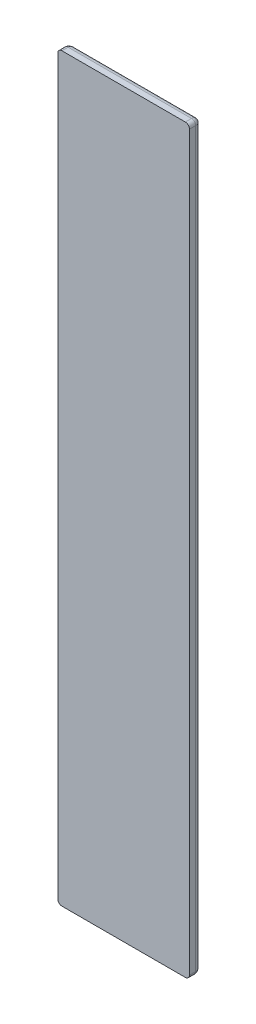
ISO-10303-21;
HEADER;
FILE_DESCRIPTION(('STEP AP214'),'2;1');
FILE_NAME('part.step','',(''),(''),'','','');
FILE_SCHEMA(('AUTOMOTIVE_DESIGN { 1 0 10303 214 1 1 1 1 }'));
ENDSEC;
DATA;
#1=APPLICATION_CONTEXT('core data for automotive mechanical design processes');
#2=APPLICATION_PROTOCOL_DEFINITION('international standard','automotive_design',2000,#1);
#3=PRODUCT_CONTEXT('',#1,'mechanical');
#4=PRODUCT('Part','Part','',(#3));
#5=PRODUCT_RELATED_PRODUCT_CATEGORY('part','',(#4));
#6=PRODUCT_DEFINITION_FORMATION('','',#4);
#7=PRODUCT_DEFINITION_CONTEXT('part definition',#1,'design');
#8=PRODUCT_DEFINITION('design','',#6,#7);
#9=PRODUCT_DEFINITION_SHAPE('','',#8);
#10=(LENGTH_UNIT() NAMED_UNIT(*) SI_UNIT(.MILLI.,.METRE.));
#11=(NAMED_UNIT(*) PLANE_ANGLE_UNIT() SI_UNIT($,.RADIAN.));
#12=(NAMED_UNIT(*) SI_UNIT($,.STERADIAN.) SOLID_ANGLE_UNIT());
#13=UNCERTAINTY_MEASURE_WITH_UNIT(LENGTH_MEASURE(1.E-05),#10,'distance_accuracy_value','');
#14=(GEOMETRIC_REPRESENTATION_CONTEXT(3) GLOBAL_UNCERTAINTY_ASSIGNED_CONTEXT((#13)) GLOBAL_UNIT_ASSIGNED_CONTEXT((#10,
#11,#12)) REPRESENTATION_CONTEXT('',''));
#15=CARTESIAN_POINT('',(0.,0.,0.));
#16=DIRECTION('',(0.,0.,1.));
#17=DIRECTION('',(1.,0.,0.));
#18=AXIS2_PLACEMENT_3D('',#15,#16,#17);
#19=CARTESIAN_POINT('',(21.5,-90.,1.5));
#20=CARTESIAN_POINT('',(21.6495996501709,-90.,1.5));
#21=CARTESIAN_POINT('',(21.8738175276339,-89.9486359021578,1.5));
#22=CARTESIAN_POINT('',(22.128698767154,-89.788318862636,1.5));
#23=CARTESIAN_POINT('',(22.3150612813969,-89.6021463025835,1.5));
#24=CARTESIAN_POINT('',(22.4618741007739,-89.3365606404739,1.5));
#25=CARTESIAN_POINT('',(22.5,-89.1121997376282,1.5));
#26=CARTESIAN_POINT('',(22.5,-89.,1.5));
#27=CARTESIAN_POINT('',(21.5,-90.,1.3878002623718));
#28=CARTESIAN_POINT('',(21.6495996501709,-90.,1.37658410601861));
#29=CARTESIAN_POINT('',(21.8738175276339,-89.9486359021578,1.36367785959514));
#30=CARTESIAN_POINT('',(22.128698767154,-89.788318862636,1.35659921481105));
#31=CARTESIAN_POINT('',(22.3150612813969,-89.6021463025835,1.35658906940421));
#32=CARTESIAN_POINT('',(22.4618741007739,-89.3365606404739,1.36547389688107));
#33=CARTESIAN_POINT('',(22.5,-89.1121997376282,1.37940644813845));
#34=CARTESIAN_POINT('',(22.5,-89.,1.3878002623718));
#35=CARTESIAN_POINT('',(21.493667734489,-89.9810032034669,1.219526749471));
#36=CARTESIAN_POINT('',(21.6388090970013,-89.9769920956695,1.19181888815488));
#37=CARTESIAN_POINT('',(21.8563490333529,-89.9220037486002,1.15996961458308));
#38=CARTESIAN_POINT('',(22.1051171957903,-89.7621005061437,1.14251311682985));
#39=CARTESIAN_POINT('',(22.2883852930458,-89.5790000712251,1.14248786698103));
#40=CARTESIAN_POINT('',(22.4356014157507,-89.3201946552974,1.16439795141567));
#41=CARTESIAN_POINT('',(22.4779774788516,-89.102519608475,1.19878721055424));
#42=CARTESIAN_POINT('',(22.4810032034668,-88.993667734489,1.21952674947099));
#43=CARTESIAN_POINT('',(21.4625698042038,-89.8877094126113,0.895595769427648));
#44=CARTESIAN_POINT('',(21.5887416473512,-89.8682079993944,0.846186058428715));
#45=CARTESIAN_POINT('',(21.777929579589,-89.8004923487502,0.789964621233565));
#46=CARTESIAN_POINT('',(21.9999211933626,-89.6445412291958,0.759269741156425));
#47=CARTESIAN_POINT('',(22.1687376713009,-89.4758439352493,0.759231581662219));
#48=CARTESIAN_POINT('',(22.3152374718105,-89.246456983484,0.797735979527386));
#49=CARTESIAN_POINT('',(22.3731260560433,-89.0572122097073,0.858603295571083));
#50=CARTESIAN_POINT('',(22.3877094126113,-88.9625698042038,0.895595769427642));
#51=CARTESIAN_POINT('',(21.3892697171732,-89.6678091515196,0.496993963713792));
#52=CARTESIAN_POINT('',(21.4789192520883,-89.623519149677,0.445950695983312));
#53=CARTESIAN_POINT('',(21.6134299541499,-89.5389404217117,0.389505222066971));
#54=CARTESIAN_POINT('',(21.7810385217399,-89.3980404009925,0.359032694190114));
#55=CARTESIAN_POINT('',(21.917580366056,-89.2615383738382,0.359011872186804));
#56=CARTESIAN_POINT('',(22.0546353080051,-89.0910155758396,0.397175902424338));
#57=CARTESIAN_POINT('',(22.1346752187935,-88.9565306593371,0.458745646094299));
#58=CARTESIAN_POINT('',(22.1678091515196,-88.8892697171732,0.49699396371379));
#59=CARTESIAN_POINT('',(21.224368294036,-89.1731048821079,0.10246851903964));
#60=CARTESIAN_POINT('',(21.2669560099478,-89.130154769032,0.088465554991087));
#61=CARTESIAN_POINT('',(21.3308756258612,-89.0659334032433,0.073741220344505));
#62=CARTESIAN_POINT('',(21.4162264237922,-88.9803112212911,0.065952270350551));
#63=CARTESIAN_POINT('',(21.4910125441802,-88.9055420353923,0.065954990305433));
#64=CARTESIAN_POINT('',(21.5766541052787,-88.8202186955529,0.075680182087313));
#65=CARTESIAN_POINT('',(21.6409618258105,-88.7563271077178,0.091957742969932));
#66=CARTESIAN_POINT('',(21.6731048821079,-88.724368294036,0.102468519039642));
#67=CARTESIAN_POINT('',(21.0747998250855,-88.7243994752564,0.));
#68=CARTESIAN_POINT('',(21.089047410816,-88.7101518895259,0.));
#69=CARTESIAN_POINT('',(21.1104187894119,-88.68878051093,0.));
#70=CARTESIAN_POINT('',(21.138913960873,-88.6602853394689,0.));
#71=CARTESIAN_POINT('',(21.1638472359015,-88.6353520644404,0.));
#72=CARTESIAN_POINT('',(21.1923424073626,-88.6068568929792,0.));
#73=CARTESIAN_POINT('',(21.2137137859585,-88.5854855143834,0.));
#74=CARTESIAN_POINT('',(21.2243994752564,-88.5747998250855,0.));
#75=CARTESIAN_POINT('',(21.,-88.5,0.));
#76=CARTESIAN_POINT('',(21.,-88.5,0.));
#77=CARTESIAN_POINT('',(21.,-88.5,0.));
#78=CARTESIAN_POINT('',(21.,-88.5,0.));
#79=CARTESIAN_POINT('',(21.,-88.5,0.));
#80=CARTESIAN_POINT('',(21.,-88.5,0.));
#81=CARTESIAN_POINT('',(21.,-88.5,0.));
#82=CARTESIAN_POINT('',(21.,-88.5,0.));
#83=B_SPLINE_SURFACE_WITH_KNOTS('',3,3,((#19,#20,#21,#22,#23,#24,#25,#26),(#27,#28,#29,#30,#31,
#32,#33,#34),(#35,#36,#37,#38,#39,#40,#41,#42),(#43,#44,#45,#46,#47,#48,#49,#50),(#51,#52,#53,
#54,#55,#56,#57,#58),(#59,#60,#61,#62,#63,#64,#65,#66),(#67,#68,#69,#70,#71,#72,#73,#74),(#75,
#76,#77,#78,#79,#80,#81,#82)),.UNSPECIFIED.,.F.,.F.,.F.,(4,1,1,1,1,4),(4,1,1,1,1,4),(0.,
0.224399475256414,0.336599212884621,0.673198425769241,1.12199737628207,1.5707963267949),(0.,
0.285714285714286,0.428571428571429,0.571428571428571,0.785714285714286,1.),.UNSPECIFIED.);
#84=CARTESIAN_POINT('',(21.,-88.5,0.));
#85=CARTESIAN_POINT('',(21.2243994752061,-88.5747998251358,0.));
#86=CARTESIAN_POINT('',(21.6731048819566,-88.7243682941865,0.102468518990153));
#87=CARTESIAN_POINT('',(22.1678091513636,-88.8892697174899,0.4969939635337));
#88=CARTESIAN_POINT('',(22.3877094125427,-88.9625698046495,0.895595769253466));
#89=CARTESIAN_POINT('',(22.4810032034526,-88.9936677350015,1.21952674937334));
#90=CARTESIAN_POINT('',(22.5,-89.0000000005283,1.38780026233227));
#91=CARTESIAN_POINT('',(22.5,-89.0000000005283,1.5));
#92=B_SPLINE_CURVE_WITH_KNOTS('',3,(#84,#85,#86,#87,#88,#89,#90,#91),.UNSPECIFIED.,.F.,.F.,(4,1,
1,1,1,4),(0.,0.448798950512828,0.897597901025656,1.23419711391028,1.34639685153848,
1.5707963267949),.UNSPECIFIED.);
#93=CARTESIAN_POINT('',(22.5,-89.0000000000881,1.5));
#94=VERTEX_POINT('',#93);
#95=CARTESIAN_POINT('',(21.,-88.5,0.));
#96=VERTEX_POINT('',#95);
#97=EDGE_CURVE('E112',#94,#96,#92,.F.);
#98=CARTESIAN_POINT('',(22.5,-89.,1.5));
#99=CARTESIAN_POINT('',(22.5,-89.1121997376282,1.5));
#100=CARTESIAN_POINT('',(22.4618741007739,-89.3365606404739,1.5));
#101=CARTESIAN_POINT('',(22.3150612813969,-89.6021463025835,1.5));
#102=CARTESIAN_POINT('',(22.128698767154,-89.788318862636,1.5));
#103=CARTESIAN_POINT('',(21.8738175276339,-89.9486359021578,1.5));
#104=CARTESIAN_POINT('',(21.6495996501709,-90.,1.5));
#105=CARTESIAN_POINT('',(21.5,-90.,1.5));
#106=B_SPLINE_CURVE_WITH_KNOTS('',3,(#98,#99,#100,#101,#102,#103,#104,#105),.UNSPECIFIED.,.F.,
.F.,(4,1,1,1,1,4),(0.,0.214285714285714,0.428571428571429,0.571428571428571,0.714285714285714,
1.),.UNSPECIFIED.);
#107=CARTESIAN_POINT('',(21.5,-90.,1.5));
#108=VERTEX_POINT('',#107);
#109=EDGE_CURVE('E95',#94,#108,#106,.T.);
#110=CARTESIAN_POINT('',(21.5,-90.,1.5));
#111=CARTESIAN_POINT('',(21.5000000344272,-90.0000001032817,1.48036481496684));
#112=CARTESIAN_POINT('',(21.4998707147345,-89.9996121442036,1.4607297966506));
#113=CARTESIAN_POINT('',(21.499354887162,-89.998064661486,1.42149068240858));
#114=CARTESIAN_POINT('',(21.4989683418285,-89.9969050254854,1.40188659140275));
#115=CARTESIAN_POINT('',(21.4979394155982,-89.9938182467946,1.3627392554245));
#116=CARTESIAN_POINT('',(21.4972969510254,-89.9918908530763,1.34319603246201));
#117=CARTESIAN_POINT('',(21.4957575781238,-89.9872727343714,1.30420023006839));
#118=CARTESIAN_POINT('',(21.494860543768,-89.984581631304,1.28474770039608));
#119=CARTESIAN_POINT('',(21.4928134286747,-89.9784402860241,1.2459630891));
#120=CARTESIAN_POINT('',(21.4916631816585,-89.9749895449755,1.22663109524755));
#121=CARTESIAN_POINT('',(21.4891109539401,-89.9673328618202,1.18811739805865));
#122=CARTESIAN_POINT('',(21.4877087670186,-89.9631263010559,1.1689358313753));
#123=CARTESIAN_POINT('',(21.4846543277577,-89.953962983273,1.13075268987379));
#124=CARTESIAN_POINT('',(21.4830018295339,-89.9490054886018,1.11175131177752));
#125=CARTESIAN_POINT('',(21.4794494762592,-89.9383484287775,1.07395747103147));
#126=CARTESIAN_POINT('',(21.4775493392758,-89.9326480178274,1.05516527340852));
#127=CARTESIAN_POINT('',(21.4735040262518,-89.9205120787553,1.0178190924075));
#128=CARTESIAN_POINT('',(21.4713585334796,-89.9140756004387,0.9992654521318));
#129=CARTESIAN_POINT('',(21.4668259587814,-89.9004778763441,0.962424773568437));
#130=CARTESIAN_POINT('',(21.4644385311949,-89.8933155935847,0.944138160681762));
#131=CARTESIAN_POINT('',(21.4594269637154,-89.8782808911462,0.907858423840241));
#132=CARTESIAN_POINT('',(21.4568024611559,-89.8704073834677,0.889865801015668));
#133=CARTESIAN_POINT('',(21.451321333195,-89.8539639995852,0.854201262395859));
#134=CARTESIAN_POINT('',(21.4484643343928,-89.8453930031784,0.836529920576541));
#135=CARTESIAN_POINT('',(21.4425228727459,-89.8275686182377,0.801535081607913));
#136=CARTESIAN_POINT('',(21.4394380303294,-89.8183140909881,0.784212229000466));
#137=CARTESIAN_POINT('',(21.4330455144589,-89.7991365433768,0.749941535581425));
#138=CARTESIAN_POINT('',(21.4297374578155,-89.7892123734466,0.732994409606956));
#139=CARTESIAN_POINT('',(21.4229031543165,-89.7687094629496,0.699502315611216));
#140=CARTESIAN_POINT('',(21.4193765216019,-89.7581295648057,0.682958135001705));
#141=CARTESIAN_POINT('',(21.4121096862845,-89.7363290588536,0.650299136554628));
#142=CARTESIAN_POINT('',(21.4083690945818,-89.7251072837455,0.634185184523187));
#143=CARTESIAN_POINT('',(21.4006790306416,-89.7020370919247,0.602413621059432));
#144=CARTESIAN_POINT('',(21.3967291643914,-89.6901874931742,0.586756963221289));
#145=CARTESIAN_POINT('',(21.3886250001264,-89.6658750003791,0.555927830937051));
#146=CARTESIAN_POINT('',(21.3844703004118,-89.6534109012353,0.540756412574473));
#147=CARTESIAN_POINT('',(21.3759640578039,-89.6278921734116,0.510917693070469));
#148=CARTESIAN_POINT('',(21.3716121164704,-89.6148363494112,0.496251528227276));
#149=CARTESIAN_POINT('',(21.3627193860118,-89.5881581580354,0.467441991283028));
#150=CARTESIAN_POINT('',(21.3581782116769,-89.5745346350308,0.453299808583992));
#151=CARTESIAN_POINT('',(21.3489148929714,-89.5467446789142,0.425557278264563));
#152=CARTESIAN_POINT('',(21.3441923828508,-89.5325771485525,0.411958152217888));
#153=CARTESIAN_POINT('',(21.334574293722,-89.5037228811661,0.385320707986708));
#154=CARTESIAN_POINT('',(21.3296783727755,-89.4890351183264,0.372283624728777));
#155=CARTESIAN_POINT('',(21.319721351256,-89.4591640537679,0.346789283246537));
#156=CARTESIAN_POINT('',(21.3146599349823,-89.4439798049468,0.334333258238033));
#157=CARTESIAN_POINT('',(21.3043798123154,-89.4131394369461,0.310020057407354));
#158=CARTESIAN_POINT('',(21.2991608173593,-89.3974824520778,0.298164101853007));
#159=CARTESIAN_POINT('',(21.2885734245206,-89.3657202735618,0.275070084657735));
#160=CARTESIAN_POINT('',(21.2832047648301,-89.3496142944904,0.263833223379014));
#161=CARTESIAN_POINT('',(21.2723259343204,-89.3169778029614,0.241996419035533));
#162=CARTESIAN_POINT('',(21.2668155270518,-89.3004465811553,0.231397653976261));
#163=CARTESIAN_POINT('',(21.2556610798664,-89.2669832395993,0.210856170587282));
#164=CARTESIAN_POINT('',(21.2500168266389,-89.2500504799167,0.200914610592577));
#165=CARTESIAN_POINT('',(21.2386026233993,-89.215807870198,0.181706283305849));
#166=CARTESIAN_POINT('',(21.2328324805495,-89.1984974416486,0.172440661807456));
#167=CARTESIAN_POINT('',(21.2211742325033,-89.1635226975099,0.154604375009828));
#168=CARTESIAN_POINT('',(21.2152859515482,-89.1458578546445,0.146034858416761));
#169=CARTESIAN_POINT('',(21.2034002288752,-89.1102006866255,0.129604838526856));
#170=CARTESIAN_POINT('',(21.1974026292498,-89.0922078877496,0.121745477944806));
#171=CARTESIAN_POINT('',(21.1853083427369,-89.0559250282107,0.106741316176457));
#172=CARTESIAN_POINT('',(21.1792115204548,-89.0376345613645,0.0995976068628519));
#173=CARTESIAN_POINT('',(21.1669286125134,-89.0007858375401,0.086032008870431));
#174=CARTESIAN_POINT('',(21.1607424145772,-88.9822272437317,0.079611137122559));
#175=CARTESIAN_POINT('',(21.1482906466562,-88.9448719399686,0.0674980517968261));
#176=CARTESIAN_POINT('',(21.1420249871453,-88.9260749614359,0.0618067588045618));
#177=CARTESIAN_POINT('',(21.129424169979,-88.888272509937,0.0511598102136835));
#178=CARTESIAN_POINT('',(21.1230889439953,-88.869266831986,0.0462049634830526));
#179=CARTESIAN_POINT('',(21.1103588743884,-88.8310766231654,0.0370378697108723));
#180=CARTESIAN_POINT('',(21.1039639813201,-88.8118919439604,0.0328263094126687));
#181=CARTESIAN_POINT('',(21.0911244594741,-88.7733733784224,0.0251527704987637));
#182=CARTESIAN_POINT('',(21.0846797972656,-88.7540393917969,0.0216913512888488));
#183=CARTESIAN_POINT('',(21.071750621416,-88.715251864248,0.015525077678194));
#184=CARTESIAN_POINT('',(21.0652660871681,-88.6957982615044,0.0128206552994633));
#185=CARTESIAN_POINT('',(21.0522670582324,-88.6568011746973,0.00817536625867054));
#186=CARTESIAN_POINT('',(21.0457525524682,-88.6372576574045,0.00623480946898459));
#187=CARTESIAN_POINT('',(21.032703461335,-88.5981103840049,0.00312421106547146));
#188=CARTESIAN_POINT('',(21.0261688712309,-88.5785066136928,0.00195436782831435));
#189=CARTESIAN_POINT('',(21.0130895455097,-88.5392686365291,0.00039224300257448));
#190=CARTESIAN_POINT('',(21.0065448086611,-88.5196344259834,6.46256730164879E-08));
#191=CARTESIAN_POINT('',(21.,-88.5,0.));
#192=B_SPLINE_CURVE_WITH_KNOTS('',3,(#110,#111,#112,#113,#114,#115,#116,#117,#118,#119,#120,
#121,#122,#123,#124,#125,#126,#127,#128,#129,#130,#131,#132,#133,#134,#135,#136,#137,#138,#139,
#140,#141,#142,#143,#144,#145,#146,#147,#148,#149,#150,#151,#152,#153,#154,#155,#156,#157,#158,
#159,#160,#161,#162,#163,#164,#165,#166,#167,#168,#169,#170,#171,#172,#173,#174,#175,#176,#177,
#178,#179,#180,#181,#182,#183,#184,#185,#186,#187,#188,#189,#190,#191),.UNSPECIFIED.,.F.,.F.,(4,
2,2,2,2,2,2,2,2,2,2,2,2,2,2,2,2,2,2,2,2,2,2,2,2,2,2,2,2,2,2,2,2,2,2,2,2,2,2,2,4),(0.,
0.0589010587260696,0.117810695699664,0.17673960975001,0.235697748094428,0.294694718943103,
0.353740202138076,0.412844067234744,0.472015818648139,0.531264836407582,0.590599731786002,
0.650026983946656,0.709551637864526,0.769177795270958,0.828909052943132,0.888748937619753,
0.948701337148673,1.0087709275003,1.06896340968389,1.12928343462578,1.18973290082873,
1.25031145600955,1.31101695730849,1.37184592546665,1.43279399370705,1.49385635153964,
1.55502818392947,1.61630510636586,1.67768359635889,1.73916139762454,1.80073642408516,
1.86240400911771,1.92415729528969,1.98598775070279,2.04788562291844,2.10984038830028,
2.1718411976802,2.23387731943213,2.29593858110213,2.35801581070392,2.42010127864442),.UNSPECIFIED.);
#193=EDGE_CURVE('E116',#96,#108,#192,.F.);
#194=ORIENTED_EDGE('',*,*,#97,.F.);
#195=ORIENTED_EDGE('',*,*,#109,.T.);
#196=ORIENTED_EDGE('',*,*,#193,.F.);
#197=EDGE_LOOP('',(#194,#195,#196));
#198=FACE_BOUND('',#197,.T.);
#199=ADVANCED_FACE('F15',(#198),#83,.T.);
#200=CARTESIAN_POINT('',(22.5,89.,1.5));
#201=CARTESIAN_POINT('',(22.5,89.1495996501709,1.5));
#202=CARTESIAN_POINT('',(22.4486359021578,89.3738175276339,1.5));
#203=CARTESIAN_POINT('',(22.288318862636,89.628698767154,1.5));
#204=CARTESIAN_POINT('',(22.1021463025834,89.8150612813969,1.5));
#205=CARTESIAN_POINT('',(21.8365606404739,89.9618741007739,1.5));
#206=CARTESIAN_POINT('',(21.6121997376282,90.,1.5));
#207=CARTESIAN_POINT('',(21.5,90.,1.5));
#208=CARTESIAN_POINT('',(22.5,89.,1.38780026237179));
#209=CARTESIAN_POINT('',(22.5,89.1495996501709,1.3765841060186));
#210=CARTESIAN_POINT('',(22.4486359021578,89.3738175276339,1.36367785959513));
#211=CARTESIAN_POINT('',(22.288318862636,89.628698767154,1.35659921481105));
#212=CARTESIAN_POINT('',(22.1021463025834,89.8150612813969,1.3565890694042));
#213=CARTESIAN_POINT('',(21.8365606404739,89.9618741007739,1.36547389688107));
#214=CARTESIAN_POINT('',(21.6121997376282,90.,1.37940644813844));
#215=CARTESIAN_POINT('',(21.5,90.,1.38780026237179));
#216=CARTESIAN_POINT('',(22.4747625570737,88.9915875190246,1.16338542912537));
#217=CARTESIAN_POINT('',(22.4692834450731,89.1351526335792,1.12989688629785));
#218=CARTESIAN_POINT('',(22.4129448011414,89.3503381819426,1.09139862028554));
#219=CARTESIAN_POINT('',(22.2530897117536,89.5969880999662,1.07029653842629));
#220=CARTESIAN_POINT('',(22.0710158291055,89.7792239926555,1.07026603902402));
#221=CARTESIAN_POINT('',(21.8145715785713,89.9266853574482,1.09675187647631));
#222=CARTESIAN_POINT('',(21.5992585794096,89.9706398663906,1.13831950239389));
#223=CARTESIAN_POINT('',(21.4915875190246,89.9747625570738,1.16338542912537));
#224=CARTESIAN_POINT('',(22.3628176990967,88.9542725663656,0.843755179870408));
#225=CARTESIAN_POINT('',(22.3396559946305,89.0757403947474,0.793168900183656));
#226=CARTESIAN_POINT('',(22.2691014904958,89.2578905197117,0.735815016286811));
#227=CARTESIAN_POINT('',(22.1144742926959,89.4731021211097,0.704545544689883));
#228=CARTESIAN_POINT('',(21.9495620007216,89.6381215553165,0.704508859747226));
#229=CARTESIAN_POINT('',(21.7275819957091,89.7840738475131,0.74372626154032));
#230=CARTESIAN_POINT('',(21.5453891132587,89.8454967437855,0.805877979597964));
#231=CARTESIAN_POINT('',(21.4542725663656,89.8628176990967,0.843755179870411));
#232=CARTESIAN_POINT('',(22.1227698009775,88.8742566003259,0.461143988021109));
#233=CARTESIAN_POINT('',(22.0786617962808,88.9596853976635,0.413712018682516));
#234=CARTESIAN_POINT('',(21.9960466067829,89.0878670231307,0.361347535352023));
#235=CARTESIAN_POINT('',(21.8602333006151,89.2480479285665,0.333096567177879));
#236=CARTESIAN_POINT('',(21.7293501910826,89.3789711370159,0.333078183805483));
#237=CARTESIAN_POINT('',(21.5665071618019,89.5112733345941,0.368456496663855));
#238=CARTESIAN_POINT('',(21.4383528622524,89.5897766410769,0.425599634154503));
#239=CARTESIAN_POINT('',(21.3742566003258,89.6227698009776,0.461143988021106));
#240=CARTESIAN_POINT('',(21.6731499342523,88.7243833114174,0.10246319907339));
#241=CARTESIAN_POINT('',(21.6301561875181,88.766924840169,0.088219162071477));
#242=CARTESIAN_POINT('',(21.5658590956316,88.830777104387,0.073201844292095));
#243=CARTESIAN_POINT('',(21.480183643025,88.9160923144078,0.065249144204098));
#244=CARTESIAN_POINT('',(21.4054065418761,88.9908860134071,0.065251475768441));
#245=CARTESIAN_POINT('',(21.3201307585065,89.0765927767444,0.075182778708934));
#246=CARTESIAN_POINT('',(21.2563079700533,89.1409756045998,0.091772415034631));
#247=CARTESIAN_POINT('',(21.2243833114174,89.1731499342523,0.102463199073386));
#248=CARTESIAN_POINT('',(21.2243994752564,88.5747998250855,0.));
#249=CARTESIAN_POINT('',(21.2101518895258,88.589047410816,0.));
#250=CARTESIAN_POINT('',(21.18878051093,88.6104187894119,0.));
#251=CARTESIAN_POINT('',(21.1602853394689,88.638913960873,0.));
#252=CARTESIAN_POINT('',(21.1353520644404,88.6638472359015,0.));
#253=CARTESIAN_POINT('',(21.1068568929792,88.6923424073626,0.));
#254=CARTESIAN_POINT('',(21.0854855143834,88.7137137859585,0.));
#255=CARTESIAN_POINT('',(21.0747998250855,88.7243994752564,0.));
#256=CARTESIAN_POINT('',(21.,88.5,0.));
#257=CARTESIAN_POINT('',(21.,88.5,0.));
#258=CARTESIAN_POINT('',(21.,88.5,0.));
#259=CARTESIAN_POINT('',(21.,88.5,0.));
#260=CARTESIAN_POINT('',(21.,88.5,0.));
#261=CARTESIAN_POINT('',(21.,88.5,0.));
#262=CARTESIAN_POINT('',(21.,88.5,0.));
#263=CARTESIAN_POINT('',(21.,88.5,0.));
#264=B_SPLINE_SURFACE_WITH_KNOTS('',3,3,((#200,#201,#202,#203,#204,#205,#206,#207),(#208,#209,
#210,#211,#212,#213,#214,#215),(#216,#217,#218,#219,#220,#221,#222,#223),(#224,#225,#226,#227,
#228,#229,#230,#231),(#232,#233,#234,#235,#236,#237,#238,#239),(#240,#241,#242,#243,#244,#245,
#246,#247),(#248,#249,#250,#251,#252,#253,#254,#255),(#256,#257,#258,#259,#260,#261,#262,#263)),
.UNSPECIFIED.,.F.,.F.,.F.,(4,1,1,1,1,4),(4,1,1,1,1,4),(0.,0.224399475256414,0.448798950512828,
0.673198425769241,1.12199737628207,1.5707963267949),(0.,0.285714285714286,0.428571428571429,
0.571428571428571,0.785714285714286,1.),.UNSPECIFIED.);
#265=CARTESIAN_POINT('',(21.,88.5,0.));
#266=CARTESIAN_POINT('',(21.0747998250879,88.724399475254,0.));
#267=CARTESIAN_POINT('',(21.2243833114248,89.1731499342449,0.10246319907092));
#268=CARTESIAN_POINT('',(21.3742566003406,89.6227698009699,0.461143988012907));
#269=CARTESIAN_POINT('',(21.4542725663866,89.8628176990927,0.843755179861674));
#270=CARTESIAN_POINT('',(21.4915875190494,89.9747625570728,1.16338542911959));
#271=CARTESIAN_POINT('',(21.5000000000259,90.,1.38780026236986));
#272=CARTESIAN_POINT('',(21.5000000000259,90.,1.5));
#273=B_SPLINE_CURVE_WITH_KNOTS('',3,(#265,#266,#267,#268,#269,#270,#271,#272),.UNSPECIFIED.,.F.,
.F.,(4,1,1,1,1,4),(0.,0.448798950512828,0.897597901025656,1.12199737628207,1.34639685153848,
1.5707963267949),.UNSPECIFIED.);
#274=CARTESIAN_POINT('',(21.5000000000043,90.,1.5));
#275=VERTEX_POINT('',#274);
#276=CARTESIAN_POINT('',(21.,88.5,0.));
#277=VERTEX_POINT('',#276);
#278=EDGE_CURVE('E231',#275,#277,#273,.F.);
#279=CARTESIAN_POINT('',(21.5,90.,1.5));
#280=CARTESIAN_POINT('',(21.5130898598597,90.0000000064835,1.5));
#281=CARTESIAN_POINT('',(21.5261796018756,89.9997405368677,1.5));
#282=CARTESIAN_POINT('',(21.5523386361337,89.9987060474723,1.5));
#283=CARTESIAN_POINT('',(21.5654079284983,89.9979310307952,1.5));
#284=CARTESIAN_POINT('',(21.5915060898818,89.9958688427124,1.5));
#285=CARTESIAN_POINT('',(21.6045349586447,89.9945816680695,1.5));
#286=CARTESIAN_POINT('',(21.6305323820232,89.9914985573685,1.5));
#287=CARTESIAN_POINT('',(21.6435009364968,89.9897026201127,1.5));
#288=CARTESIAN_POINT('',(21.6693578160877,89.9856053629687,1.5));
#289=CARTESIAN_POINT('',(21.6822461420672,89.9833040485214,1.5));
#290=CARTESIAN_POINT('',(21.7079226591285,89.9781994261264,1.5));
#291=CARTESIAN_POINT('',(21.7207108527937,89.9753961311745,1.5));
#292=CARTESIAN_POINT('',(21.7461671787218,89.9692908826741,1.5));
#293=CARTESIAN_POINT('',(21.7588353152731,89.9659889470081,1.5));
#294=CARTESIAN_POINT('',(21.784031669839,89.9588899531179,1.5));
#295=CARTESIAN_POINT('',(21.7965598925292,89.9550929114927,1.5));
#296=CARTESIAN_POINT('',(21.8214563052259,89.9470065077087,1.5));
#297=CARTESIAN_POINT('',(21.8338244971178,89.9427171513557,1.5));
#298=CARTESIAN_POINT('',(21.858381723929,89.9336522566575,1.5));
#299=CARTESIAN_POINT('',(21.8705707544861,89.9288767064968,1.5));
#300=CARTESIAN_POINT('',(21.8947521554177,89.9188499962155,1.5));
#301=CARTESIAN_POINT('',(21.9067445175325,89.9135988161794,1.5));
#302=CARTESIAN_POINT('',(21.930514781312,89.9026305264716,1.5));
#303=CARTESIAN_POINT('',(21.9422926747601,89.8969133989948,1.5));
#304=CARTESIAN_POINT('',(21.9656162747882,89.8850231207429,1.5));
#305=CARTESIAN_POINT('',(21.9771619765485,89.8788499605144,1.5));
#306=CARTESIAN_POINT('',(22.0000034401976,89.8660574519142,1.5));
#307=CARTESIAN_POINT('',(22.0112992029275,89.8594381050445,1.5));
#308=CARTESIAN_POINT('',(22.0336230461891,89.8457630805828,1.5));
#309=CARTESIAN_POINT('',(22.0446511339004,89.8387074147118,1.5));
#310=CARTESIAN_POINT('',(22.0664218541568,89.8241695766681,1.5));
#311=CARTESIAN_POINT('',(22.0771644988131,89.8166874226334,1.5));
#312=CARTESIAN_POINT('',(22.098346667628,89.8013065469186,1.5));
#313=CARTESIAN_POINT('',(22.1087862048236,89.7934078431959,1.5));
#314=CARTESIAN_POINT('',(22.1293441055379,89.7772034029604,1.5));
#315=CARTESIAN_POINT('',(22.1394624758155,89.7688976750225,1.5));
#316=CARTESIAN_POINT('',(22.159363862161,89.7518935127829,1.5));
#317=CARTESIAN_POINT('',(22.1691468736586,89.7431950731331,1.5));
#318=CARTESIAN_POINT('',(22.188364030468,89.7254204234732,1.5));
#319=CARTESIAN_POINT('',(22.1977981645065,89.716344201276,1.5));
#320=CARTESIAN_POINT('',(22.2163038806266,89.6978287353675,1.5));
#321=CARTESIAN_POINT('',(22.2253754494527,89.6883894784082,1.5));
#322=CARTESIAN_POINT('',(22.2431424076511,89.6691627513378,1.5));
#323=CARTESIAN_POINT('',(22.2518377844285,89.659375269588,1.5));
#324=CARTESIAN_POINT('',(22.2688386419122,89.6394668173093,1.5));
#325=CARTESIAN_POINT('',(22.2771441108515,89.6293458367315,1.5));
#326=CARTESIAN_POINT('',(22.2933516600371,89.6087854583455,1.5));
#327=CARTESIAN_POINT('',(22.3012537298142,89.5983460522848,1.5));
#328=CARTESIAN_POINT('',(22.3166428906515,89.5771656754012,1.5));
#329=CARTESIAN_POINT('',(22.3241299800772,89.5664247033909,1.5));
#330=CARTESIAN_POINT('',(22.3386774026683,89.544657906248,1.5));
#331=CARTESIAN_POINT('',(22.3457377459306,89.5336320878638,1.5));
#332=CARTESIAN_POINT('',(22.3594198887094,89.511312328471,1.5));
#333=CARTESIAN_POINT('',(22.3660417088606,89.5000184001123,1.5));
#334=CARTESIAN_POINT('',(22.3788352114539,89.4771792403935,1.5));
#335=CARTESIAN_POINT('',(22.3850069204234,89.4656340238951,1.5));
#336=CARTESIAN_POINT('',(22.396887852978,89.4423087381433,1.5));
#337=CARTESIAN_POINT('',(22.4025971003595,89.4305286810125,1.5));
#338=CARTESIAN_POINT('',(22.4135441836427,89.4067517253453,1.5));
#339=CARTESIAN_POINT('',(22.4187820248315,89.3947548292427,1.5));
#340=CARTESIAN_POINT('',(22.4287821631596,89.3705640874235,1.5));
#341=CARTESIAN_POINT('',(22.4335444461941,89.3583702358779,1.5));
#342=CARTESIAN_POINT('',(22.4425884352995,89.33380500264,1.5));
#343=CARTESIAN_POINT('',(22.4468701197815,89.3214336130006,1.5));
#344=CARTESIAN_POINT('',(22.454948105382,89.2965328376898,1.5));
#345=CARTESIAN_POINT('',(22.458744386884,89.2840034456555,1.5));
#346=CARTESIAN_POINT('',(22.4658466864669,89.2588061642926,1.5));
#347=CARTESIAN_POINT('',(22.4691526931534,89.2461382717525,1.5));
#348=CARTESIAN_POINT('',(22.4752695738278,89.2206834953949,1.5));
#349=CARTESIAN_POINT('',(22.4780804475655,89.2078966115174,1.5));
#350=CARTESIAN_POINT('',(22.4832021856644,89.1822233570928,1.5));
#351=CARTESIAN_POINT('',(22.4855130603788,89.1693369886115,1.5));
#352=CARTESIAN_POINT('',(22.489629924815,89.1434842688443,1.5));
#353=CARTESIAN_POINT('',(22.4914359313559,89.1305179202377,1.5));
#354=CARTESIAN_POINT('',(22.4945381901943,89.1045247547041,1.5));
#355=CARTESIAN_POINT('',(22.4958344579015,89.0914979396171,1.5));
#356=CARTESIAN_POINT('',(22.4979123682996,89.065403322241,1.5));
#357=CARTESIAN_POINT('',(22.4986940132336,89.0523355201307,1.5));
#358=CARTESIAN_POINT('',(22.4997378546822,89.026178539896,1.5));
#359=CARTESIAN_POINT('',(22.5000000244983,89.0130893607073,1.5));
#360=CARTESIAN_POINT('',(22.5,89.,1.5));
#361=B_SPLINE_CURVE_WITH_KNOTS('',3,(#279,#280,#281,#282,#283,#284,#285,#286,#287,#288,#289,
#290,#291,#292,#293,#294,#295,#296,#297,#298,#299,#300,#301,#302,#303,#304,#305,#306,#307,#308,
#309,#310,#311,#312,#313,#314,#315,#316,#317,#318,#319,#320,#321,#322,#323,#324,#325,#326,#327,
#328,#329,#330,#331,#332,#333,#334,#335,#336,#337,#338,#339,#340,#341,#342,#343,#344,#345,#346,
#347,#348,#349,#350,#351,#352,#353,#354,#355,#356,#357,#358,#359,#360),.UNSPECIFIED.,.F.,.F.,(4,
2,2,2,2,2,2,2,2,2,2,2,2,2,2,2,2,2,2,2,2,2,2,2,2,2,2,2,2,2,2,2,2,2,2,2,2,2,2,2,4),(0.,
0.0392668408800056,0.0785334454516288,0.117800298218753,0.157067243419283,0.19633376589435,
0.235599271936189,0.274863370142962,0.314126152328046,0.353388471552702,0.392651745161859,
0.431916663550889,0.471183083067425,0.510450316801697,0.549717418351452,0.588983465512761,
0.628247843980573,0.667510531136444,0.706772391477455,0.746034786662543,0.785298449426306,
0.824563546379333,0.863829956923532,0.903097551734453,0.94236616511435,0.981634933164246,
1.02090277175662,1.06016876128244,1.09943243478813,1.13869408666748,1.17795529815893,
1.21721767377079,1.25648181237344,1.29574753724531,1.33501417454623,1.37428083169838,
1.413546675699,1.45281121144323,1.49207456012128,1.53133773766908,1.57060293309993),.UNSPECIFIED.);
#362=CARTESIAN_POINT('',(22.5,89.,1.5));
#363=VERTEX_POINT('',#362);
#364=EDGE_CURVE('E108',#275,#363,#361,.T.);
#365=CARTESIAN_POINT('',(22.5,89.,1.5));
#366=CARTESIAN_POINT('',(22.5000000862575,89.0000000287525,1.4803642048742));
#367=CARTESIAN_POINT('',(22.4996135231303,88.9998711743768,1.46072852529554));
#368=CARTESIAN_POINT('',(22.4980705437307,88.9993568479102,1.42148712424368));
#369=CARTESIAN_POINT('',(22.4969139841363,88.9989713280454,1.40188140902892));
#370=CARTESIAN_POINT('',(22.4938339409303,88.9979446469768,1.36273040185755));
#371=CARTESIAN_POINT('',(22.4919101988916,88.9973033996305,1.34318513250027));
#372=CARTESIAN_POINT('',(22.4872987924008,88.9957662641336,1.30418540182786));
#373=CARTESIAN_POINT('',(22.484610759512,88.9948702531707,1.28473098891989));
#374=CARTESIAN_POINT('',(22.4784739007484,88.9928246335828,1.24594333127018));
#375=CARTESIAN_POINT('',(22.4750245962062,88.9916748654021,1.22661017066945));
#376=CARTESIAN_POINT('',(22.4673677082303,88.9891225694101,1.18809549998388));
#377=CARTESIAN_POINT('',(22.4631595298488,88.9877198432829,1.16891412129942));
#378=CARTESIAN_POINT('',(22.4539899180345,88.9846633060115,1.13073287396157));
#379=CARTESIAN_POINT('',(22.4490277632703,88.9830092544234,1.11173319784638));
#380=CARTESIAN_POINT('',(22.438361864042,88.9794539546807,1.0739431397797));
#381=CARTESIAN_POINT('',(22.4326572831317,88.9775524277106,1.05515302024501));
#382=CARTESIAN_POINT('',(22.4205171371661,88.9735057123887,1.01781003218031));
#383=CARTESIAN_POINT('',(22.4140806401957,88.9713602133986,0.999257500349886));
#384=CARTESIAN_POINT('',(22.4004874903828,88.966829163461,0.962417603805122));
#385=CARTESIAN_POINT('',(22.3933298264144,88.9644432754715,0.944130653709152));
#386=CARTESIAN_POINT('',(22.3783052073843,88.9594350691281,0.907849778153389));
#387=CARTESIAN_POINT('',(22.3704371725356,88.9568123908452,0.889856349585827));
#388=CARTESIAN_POINT('',(22.3540022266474,88.9513340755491,0.854190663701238));
#389=CARTESIAN_POINT('',(22.3454341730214,88.9484780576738,0.836518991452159));
#390=CARTESIAN_POINT('',(22.3276123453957,88.9425374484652,0.801524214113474));
#391=CARTESIAN_POINT('',(22.3183573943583,88.9394524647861,0.784201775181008));
#392=CARTESIAN_POINT('',(22.2991768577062,88.9330589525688,0.749932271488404));
#393=CARTESIAN_POINT('',(22.2892500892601,88.9297500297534,0.732985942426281));
#394=CARTESIAN_POINT('',(22.2687406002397,88.9229135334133,0.699495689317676));
#395=CARTESIAN_POINT('',(22.2581566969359,88.9193855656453,0.682952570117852));
#396=CARTESIAN_POINT('',(22.236347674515,88.912115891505,0.650295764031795));
#397=CARTESIAN_POINT('',(22.225121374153,88.9083737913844,0.634182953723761));
#398=CARTESIAN_POINT('',(22.2020424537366,88.9006808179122,0.602413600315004));
#399=CARTESIAN_POINT('',(22.1901886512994,88.8967295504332,0.586758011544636));
#400=CARTESIAN_POINT('',(22.1658689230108,88.8886229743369,0.555930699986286));
#401=CARTESIAN_POINT('',(22.1534018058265,88.8844672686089,0.540760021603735));
#402=CARTESIAN_POINT('',(22.1278781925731,88.8759593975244,0.510922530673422));
#403=CARTESIAN_POINT('',(22.1148205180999,88.8716068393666,0.496256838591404));
#404=CARTESIAN_POINT('',(22.0881396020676,88.8627132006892,0.467448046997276));
#405=CARTESIAN_POINT('',(22.0745152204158,88.8581717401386,0.45330612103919));
#406=CARTESIAN_POINT('',(22.0467243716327,88.8489081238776,0.42556393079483));
#407=CARTESIAN_POINT('',(22.0325568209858,88.8441856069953,0.411964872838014));
#408=CARTESIAN_POINT('',(22.0037031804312,88.8345677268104,0.385327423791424));
#409=CARTESIAN_POINT('',(21.9890160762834,88.8296720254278,0.372290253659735));
#410=CARTESIAN_POINT('',(21.9591468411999,88.8197156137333,0.34679562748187));
#411=CARTESIAN_POINT('',(21.9439637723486,88.8146545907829,0.334339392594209));
#412=CARTESIAN_POINT('',(21.9131261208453,88.8043753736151,0.310025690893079));
#413=CARTESIAN_POINT('',(21.897470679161,88.7991568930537,0.29816943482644));
#414=CARTESIAN_POINT('',(21.8657117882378,88.7885705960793,0.275074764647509));
#415=CARTESIAN_POINT('',(21.8496075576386,88.7832025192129,0.263837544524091));
#416=CARTESIAN_POINT('',(21.8169746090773,88.7723248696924,0.241999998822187));
#417=CARTESIAN_POINT('',(21.8004451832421,88.7668150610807,0.231400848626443));
#418=CARTESIAN_POINT('',(21.7669853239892,88.7556617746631,0.210858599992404));
#419=CARTESIAN_POINT('',(21.7500542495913,88.7500180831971,0.20091666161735));
#420=CARTESIAN_POINT('',(21.7158147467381,88.7386049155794,0.181707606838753));
#421=CARTESIAN_POINT('',(21.6985057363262,88.7328352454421,0.172441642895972));
#422=CARTESIAN_POINT('',(21.6635334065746,88.7211778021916,0.154604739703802));
#423=CARTESIAN_POINT('',(21.6458695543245,88.7152898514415,0.146034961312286));
#424=CARTESIAN_POINT('',(21.6102138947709,88.7034046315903,0.12960449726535));
#425=CARTESIAN_POINT('',(21.5922216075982,88.6974072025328,0.121744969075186));
#426=CARTESIAN_POINT('',(21.5559393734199,88.6853131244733,0.106740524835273));
#427=CARTESIAN_POINT('',(21.5376490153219,88.6792163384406,0.0995967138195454));
#428=CARTESIAN_POINT('',(21.5008001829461,88.6669333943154,0.0860309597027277));
#429=CARTESIAN_POINT('',(21.4822413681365,88.6607471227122,0.0796100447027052));
#430=CARTESIAN_POINT('',(21.4448853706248,88.6482951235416,0.0674969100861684));
#431=CARTESIAN_POINT('',(21.426087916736,88.6420293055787,0.0618056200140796));
#432=CARTESIAN_POINT('',(21.3882843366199,88.6294281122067,0.0511587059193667));
#433=CARTESIAN_POINT('',(21.36927800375,88.6230926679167,0.0462038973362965));
#434=CARTESIAN_POINT('',(21.3310863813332,88.610362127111,0.0370368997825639));
#435=CARTESIAN_POINT('',(21.311900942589,88.603966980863,0.0328254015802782));
#436=CARTESIAN_POINT('',(21.2733808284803,88.5911269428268,0.0251519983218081));
#437=CARTESIAN_POINT('',(21.2540460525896,88.5846820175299,0.0216906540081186));
#438=CARTESIAN_POINT('',(21.2152569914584,88.5717523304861,0.0155245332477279));
#439=CARTESIAN_POINT('',(21.1958026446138,88.5652675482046,0.0128201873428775));
#440=CARTESIAN_POINT('',(21.1568041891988,88.5522680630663,0.00817504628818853));
#441=CARTESIAN_POINT('',(21.1372600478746,88.5457533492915,0.00623455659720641));
#442=CARTESIAN_POINT('',(21.0981117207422,88.5327039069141,0.00312407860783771));
#443=CARTESIAN_POINT('',(21.0785075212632,88.5261691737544,0.00195428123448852));
#444=CARTESIAN_POINT('',(21.03926895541,88.5130896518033,0.000392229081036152));
#445=CARTESIAN_POINT('',(21.0196345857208,88.5065448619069,6.6931341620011E-08));
#446=CARTESIAN_POINT('',(21.,88.5,0.));
#447=B_SPLINE_CURVE_WITH_KNOTS('',3,(#365,#366,#367,#368,#369,#370,#371,#372,#373,#374,#375,
#376,#377,#378,#379,#380,#381,#382,#383,#384,#385,#386,#387,#388,#389,#390,#391,#392,#393,#394,
#395,#396,#397,#398,#399,#400,#401,#402,#403,#404,#405,#406,#407,#408,#409,#410,#411,#412,#413,
#414,#415,#416,#417,#418,#419,#420,#421,#422,#423,#424,#425,#426,#427,#428,#429,#430,#431,#432,
#433,#434,#435,#436,#437,#438,#439,#440,#441,#442,#443,#444,#445,#446),.UNSPECIFIED.,.F.,.F.,(4,
2,2,2,2,2,2,2,2,2,2,2,2,2,2,2,2,2,2,2,2,2,2,2,2,2,2,2,2,2,2,2,2,2,2,2,2,2,2,2,4),(0.,
0.0589029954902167,0.117816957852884,0.176750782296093,0.235713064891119,0.294712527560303,
0.353758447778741,0.412861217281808,0.472031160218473,0.531277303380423,0.590607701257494,
0.650029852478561,0.709551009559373,0.769176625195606,0.828910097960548,0.888754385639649,
0.948712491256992,1.00878790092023,1.06898500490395,1.12930803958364,1.1897589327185,
1.25033742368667,1.31104151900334,1.37186794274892,1.43281258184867,1.49387092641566,
1.55503850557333,1.61631131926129,1.67768626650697,1.73916153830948,1.80073525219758,
1.8624026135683,1.92415659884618,1.98598849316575,2.04788834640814,2.10984542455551,
2.17184865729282,2.23388708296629,2.29595029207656,2.35802887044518,2.42011484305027),.UNSPECIFIED.);
#448=EDGE_CURVE('E123',#277,#363,#447,.F.);
#449=ORIENTED_EDGE('',*,*,#278,.F.);
#450=ORIENTED_EDGE('',*,*,#364,.T.);
#451=ORIENTED_EDGE('',*,*,#448,.F.);
#452=EDGE_LOOP('',(#449,#450,#451));
#453=FACE_BOUND('',#452,.T.);
#454=ADVANCED_FACE('F331',(#453),#264,.T.);
#455=CARTESIAN_POINT('',(-8.50000000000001,90.,1.5));
#456=CARTESIAN_POINT('',(-8.64959965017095,90.,1.5));
#457=CARTESIAN_POINT('',(-8.87381776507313,89.948636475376,1.5));
#458=CARTESIAN_POINT('',(-9.12869900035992,89.7883193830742,1.5));
#459=CARTESIAN_POINT('',(-9.3150614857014,89.6021467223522,1.5));
#460=CARTESIAN_POINT('',(-9.46187428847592,89.3365609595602,1.5));
#461=CARTESIAN_POINT('',(-9.50000000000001,89.1121997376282,1.5));
#462=CARTESIAN_POINT('',(-9.50000000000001,89.,1.5));
#463=CARTESIAN_POINT('',(-8.50000000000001,90.,1.38780026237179));
#464=CARTESIAN_POINT('',(-8.64959965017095,90.,1.3765841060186));
#465=CARTESIAN_POINT('',(-8.87381776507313,89.948636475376,1.36367785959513));
#466=CARTESIAN_POINT('',(-9.12869900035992,89.7883193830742,1.35659921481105));
#467=CARTESIAN_POINT('',(-9.3150614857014,89.6021467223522,1.3565890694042));
#468=CARTESIAN_POINT('',(-9.46187428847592,89.3365609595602,1.36547389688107));
#469=CARTESIAN_POINT('',(-9.50000000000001,89.1121997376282,1.37940644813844));
#470=CARTESIAN_POINT('',(-9.50000000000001,89.,1.38780026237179));
#471=CARTESIAN_POINT('',(-8.4915874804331,89.9747624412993,1.16338507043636));
#472=CARTESIAN_POINT('',(-8.63515298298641,89.96928430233,1.12989763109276));
#473=CARTESIAN_POINT('',(-8.85033907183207,89.9129460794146,1.0913993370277));
#474=CARTESIAN_POINT('',(-9.09698929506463,89.7530912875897,1.07029760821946));
#475=CARTESIAN_POINT('',(-9.27922522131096,89.5710171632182,1.07026702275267));
#476=CARTESIAN_POINT('',(-9.42668625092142,89.314572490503,1.09675255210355));
#477=CARTESIAN_POINT('',(-9.47064011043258,89.0992587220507,1.13831958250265));
#478=CARTESIAN_POINT('',(-9.47476244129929,88.9915874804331,1.16338507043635));
#479=CARTESIAN_POINT('',(-8.45427250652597,89.8628175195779,0.843754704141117));
#480=CARTESIAN_POINT('',(-8.57574084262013,89.839657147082,0.793169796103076));
#481=CARTESIAN_POINT('',(-8.75789158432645,89.7691029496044,0.735816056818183));
#482=CARTESIAN_POINT('',(-8.97310357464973,89.6144761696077,0.704547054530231));
#483=CARTESIAN_POINT('',(-9.13812305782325,89.4495635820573,0.704510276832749));
#484=CARTESIAN_POINT('',(-9.28407491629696,89.2275830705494,0.743727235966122));
#485=CARTESIAN_POINT('',(-9.34549703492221,89.045389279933,0.805878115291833));
#486=CARTESIAN_POINT('',(-9.36281751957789,88.954272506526,0.843754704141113));
#487=CARTESIAN_POINT('',(-8.37425656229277,89.6227696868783,0.461143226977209));
#488=CARTESIAN_POINT('',(-8.45968593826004,89.5786633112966,0.413712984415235));
#489=CARTESIAN_POINT('',(-8.58786810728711,89.4960479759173,0.3613489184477));
#490=CARTESIAN_POINT('',(-8.74804940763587,89.3602351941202,0.333098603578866));
#491=CARTESIAN_POINT('',(-8.87897266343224,89.2293517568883,0.333080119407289));
#492=CARTESIAN_POINT('',(-9.01127438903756,89.0665082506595,0.368457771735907));
#493=CARTESIAN_POINT('',(-9.08977699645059,88.9383530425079,0.425599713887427));
#494=CARTESIAN_POINT('',(-9.12276968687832,88.8742565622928,0.461143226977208));
#495=CARTESIAN_POINT('',(-8.22438325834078,89.1731497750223,0.102461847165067));
#496=CARTESIAN_POINT('',(-8.26692548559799,89.1301579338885,0.088219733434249));
#497=CARTESIAN_POINT('',(-8.33077839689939,89.065860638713,0.073203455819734));
#498=CARTESIAN_POINT('',(-8.41609411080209,88.9801858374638,0.065251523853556));
#499=CARTESIAN_POINT('',(-8.49088788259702,88.9054083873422,0.065253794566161));
#500=CARTESIAN_POINT('',(-8.57659405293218,88.8201320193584,0.075184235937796));
#501=CARTESIAN_POINT('',(-8.64097603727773,88.7563082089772,0.091772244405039));
#502=CARTESIAN_POINT('',(-8.67314977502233,88.7243832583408,0.102461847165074));
#503=CARTESIAN_POINT('',(-8.07479982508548,88.7243994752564,0.));
#504=CARTESIAN_POINT('',(-8.08904741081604,88.7101518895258,0.));
#505=CARTESIAN_POINT('',(-8.11041878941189,88.68878051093,0.));
#506=CARTESIAN_POINT('',(-8.13891396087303,88.6602853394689,0.));
#507=CARTESIAN_POINT('',(-8.16384723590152,88.6353520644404,0.));
#508=CARTESIAN_POINT('',(-8.19234240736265,88.6068568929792,0.));
#509=CARTESIAN_POINT('',(-8.2137137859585,88.5854855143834,0.));
#510=CARTESIAN_POINT('',(-8.22439947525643,88.5747998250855,0.));
#511=CARTESIAN_POINT('',(-8.00000000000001,88.5,0.));
#512=CARTESIAN_POINT('',(-8.00000000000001,88.5,0.));
#513=CARTESIAN_POINT('',(-8.00000000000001,88.5,0.));
#514=CARTESIAN_POINT('',(-8.00000000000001,88.5,0.));
#515=CARTESIAN_POINT('',(-8.00000000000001,88.5,0.));
#516=CARTESIAN_POINT('',(-8.00000000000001,88.5,0.));
#517=CARTESIAN_POINT('',(-8.00000000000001,88.5,0.));
#518=CARTESIAN_POINT('',(-8.00000000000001,88.5,0.));
#519=B_SPLINE_SURFACE_WITH_KNOTS('',3,3,((#455,#456,#457,#458,#459,#460,#461,#462),(#463,#464,
#465,#466,#467,#468,#469,#470),(#471,#472,#473,#474,#475,#476,#477,#478),(#479,#480,#481,#482,
#483,#484,#485,#486),(#487,#488,#489,#490,#491,#492,#493,#494),(#495,#496,#497,#498,#499,#500,
#501,#502),(#503,#504,#505,#506,#507,#508,#509,#510),(#511,#512,#513,#514,#515,#516,#517,#518)),
.UNSPECIFIED.,.F.,.F.,.F.,(4,1,1,1,1,4),(4,1,1,1,1,4),(0.,0.224399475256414,0.448798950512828,
0.673198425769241,1.12199737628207,1.5707963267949),(0.,0.285714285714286,0.428571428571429,
0.571428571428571,0.785714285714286,1.),.UNSPECIFIED.);
#520=CARTESIAN_POINT('',(-8.00000000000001,88.5,0.));
#521=CARTESIAN_POINT('',(-8.22439947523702,88.5747998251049,0.));
#522=CARTESIAN_POINT('',(-8.67314977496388,88.7243832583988,0.102461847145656));
#523=CARTESIAN_POINT('',(-9.12276968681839,88.8742565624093,0.461143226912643));
#524=CARTESIAN_POINT('',(-9.36281751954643,88.9542725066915,0.843754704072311));
#525=CARTESIAN_POINT('',(-9.4747624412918,88.9915874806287,1.16338507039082));
#526=CARTESIAN_POINT('',(-9.50000000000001,89.0000000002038,1.38780026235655));
#527=CARTESIAN_POINT('',(-9.50000000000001,89.0000000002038,1.5));
#528=B_SPLINE_CURVE_WITH_KNOTS('',3,(#520,#521,#522,#523,#524,#525,#526,#527),.UNSPECIFIED.,.F.,
.F.,(4,1,1,1,1,4),(0.,0.448798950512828,0.897597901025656,1.12199737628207,1.34639685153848,
1.5707963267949),.UNSPECIFIED.);
#529=CARTESIAN_POINT('',(-9.49999999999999,89.0000000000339,1.5));
#530=VERTEX_POINT('',#529);
#531=CARTESIAN_POINT('',(-8.00000000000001,88.5,0.));
#532=VERTEX_POINT('',#531);
#533=EDGE_CURVE('E170',#530,#532,#528,.F.);
#534=CARTESIAN_POINT('',(-9.50000000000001,89.,1.5));
#535=CARTESIAN_POINT('',(-9.5000000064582,89.0130898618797,1.5));
#536=CARTESIAN_POINT('',(-9.49974053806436,89.0261796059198,1.5));
#537=CARTESIAN_POINT('',(-9.49870605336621,89.052338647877,1.5));
#538=CARTESIAN_POINT('',(-9.49793104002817,89.0654079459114,1.5));
#539=CARTESIAN_POINT('',(-9.49586886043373,89.0915061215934,1.5));
#540=CARTESIAN_POINT('',(-9.49458169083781,89.1045349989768,1.5));
#541=CARTESIAN_POINT('',(-9.49149859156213,89.1305324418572,1.5));
#542=CARTESIAN_POINT('',(-9.48970266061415,89.1435010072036,1.5));
#543=CARTESIAN_POINT('',(-9.48560541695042,89.169357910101,1.5));
#544=CARTESIAN_POINT('',(-9.48330410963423,89.1822462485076,1.5));
#545=CARTESIAN_POINT('',(-9.47819950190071,89.2079227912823,1.5));
#546=CARTESIAN_POINT('',(-9.47539621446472,89.2207109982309,1.5));
#547=CARTESIAN_POINT('',(-9.46929098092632,89.2461673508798,1.5));
#548=CARTESIAN_POINT('',(-9.46598905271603,89.2588355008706,1.5));
#549=CARTESIAN_POINT('',(-9.45889007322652,89.2840318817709,1.5));
#550=CARTESIAN_POINT('',(-9.45509303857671,89.2965601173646,1.5));
#551=CARTESIAN_POINT('',(-9.44700664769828,89.3214565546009,1.5));
#552=CARTESIAN_POINT('',(-9.44271729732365,89.3338247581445,1.5));
#553=CARTESIAN_POINT('',(-9.43365241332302,89.358382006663,1.5));
#554=CARTESIAN_POINT('',(-9.4288768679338,89.3705710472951,1.5));
#555=CARTESIAN_POINT('',(-9.4188501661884,89.3947524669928,1.5));
#556=CARTESIAN_POINT('',(-9.41359898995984,89.4067448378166,1.5));
#557=CARTESIAN_POINT('',(-9.40263070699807,89.4305151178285,1.5));
#558=CARTESIAN_POINT('',(-9.39691358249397,89.4422930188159,1.5));
#559=CARTESIAN_POINT('',(-9.3850233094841,89.4656166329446,1.5));
#560=CARTESIAN_POINT('',(-9.37885015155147,89.4771623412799,1.5));
#561=CARTESIAN_POINT('',(-9.36605764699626,89.5000038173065,1.5));
#562=CARTESIAN_POINT('',(-9.35943830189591,89.5112995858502,1.5));
#563=CARTESIAN_POINT('',(-9.34576328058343,89.5336234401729,1.5));
#564=CARTESIAN_POINT('',(-9.33870761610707,89.5446515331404,1.5));
#565=CARTESIAN_POINT('',(-9.32416978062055,89.5664222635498,1.5));
#566=CARTESIAN_POINT('',(-9.31668762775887,89.5771649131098,1.5));
#567=CARTESIAN_POINT('',(-9.30130675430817,89.5983470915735,1.5));
#568=CARTESIAN_POINT('',(-9.29340805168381,89.6087866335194,1.5));
#569=CARTESIAN_POINT('',(-9.27720361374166,89.6293445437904,1.5));
#570=CARTESIAN_POINT('',(-9.2688978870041,89.6394629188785,1.5));
#571=CARTESIAN_POINT('',(-9.25189372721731,89.6593643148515,1.5));
#572=CARTESIAN_POINT('',(-9.24319528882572,89.6691473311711,1.5));
#573=CARTESIAN_POINT('',(-9.22542064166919,89.6883644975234,1.5));
#574=CARTESIAN_POINT('',(-9.21634442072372,89.6977986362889,1.5));
#575=CARTESIAN_POINT('',(-9.19782895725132,89.7163043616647,1.5));
#576=CARTESIAN_POINT('',(-9.18838970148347,89.7253759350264,1.5));
#577=CARTESIAN_POINT('',(-9.16916297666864,89.7431429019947,1.5));
#578=CARTESIAN_POINT('',(-9.1593754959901,89.7518382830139,1.5));
#579=CARTESIAN_POINT('',(-9.13946704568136,89.7688391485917,1.5));
#580=CARTESIAN_POINT('',(-9.12934606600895,89.7771446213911,1.5));
#581=CARTESIAN_POINT('',(-9.10878568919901,89.7933521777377,1.5));
#582=CARTESIAN_POINT('',(-9.09834628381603,89.8012542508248,1.5));
#583=CARTESIAN_POINT('',(-9.07716590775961,89.8166434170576,1.5));
#584=CARTESIAN_POINT('',(-9.06642493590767,89.8241305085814,1.5));
#585=CARTESIAN_POINT('',(-9.04465813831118,89.8386779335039,1.5));
#586=CARTESIAN_POINT('',(-9.03363231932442,89.8457382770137,1.5));
#587=CARTESIAN_POINT('',(-9.01131255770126,89.8594204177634,1.5));
#588=CARTESIAN_POINT('',(-9.00001862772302,89.8660422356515,1.5));
#589=CARTESIAN_POINT('',(-8.97717946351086,89.8788357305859,1.5));
#590=CARTESIAN_POINT('',(-8.96563424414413,89.8850074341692,1.5));
#591=CARTESIAN_POINT('',(-8.94230895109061,89.8968883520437,1.5));
#592=CARTESIAN_POINT('',(-8.93052888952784,89.9025975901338,1.5));
#593=CARTESIAN_POINT('',(-8.90675192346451,89.9135446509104,1.5));
#594=CARTESIAN_POINT('',(-8.89475502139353,89.918782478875,1.5));
#595=CARTESIAN_POINT('',(-8.87056426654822,89.9287825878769,1.5));
#596=CARTESIAN_POINT('',(-8.85837040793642,89.9335448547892,1.5));
#597=CARTESIAN_POINT('',(-8.83380515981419,89.9425888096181,1.5));
#598=CARTESIAN_POINT('',(-8.82143376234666,89.9468704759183,1.5));
#599=CARTESIAN_POINT('',(-8.79653297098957,89.9549484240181,1.5));
#600=CARTESIAN_POINT('',(-8.78400357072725,89.9587446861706,1.5));
#601=CARTESIAN_POINT('',(-8.75880627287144,89.9658469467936,1.5));
#602=CARTESIAN_POINT('',(-8.74613837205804,89.96915293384,1.5));
#603=CARTESIAN_POINT('',(-8.72068357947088,89.9752697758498,1.5));
#604=CARTESIAN_POINT('',(-8.70789668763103,89.9780806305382,1.5));
#605=CARTESIAN_POINT('',(-8.68222341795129,89.9832023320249,1.5));
#606=CARTESIAN_POINT('',(-8.669337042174,89.9855131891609,1.5));
#607=CARTESIAN_POINT('',(-8.64348430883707,89.9896300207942,1.5));
#608=CARTESIAN_POINT('',(-8.63051795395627,89.9914360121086,1.5));
#609=CARTESIAN_POINT('',(-8.60452477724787,89.9945382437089,1.5));
#610=CARTESIAN_POINT('',(-8.59149795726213,89.9958344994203,1.5));
#611=CARTESIAN_POINT('',(-8.56540333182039,89.9979123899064,1.5));
#612=CARTESIAN_POINT('',(-8.55233552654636,89.9986940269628,1.5));
#613=CARTESIAN_POINT('',(-8.52617854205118,89.9997378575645,1.5));
#614=CARTESIAN_POINT('',(-8.51308936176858,90.0000000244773,1.5));
#615=CARTESIAN_POINT('',(-8.50000000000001,90.,1.5));
#616=B_SPLINE_CURVE_WITH_KNOTS('',3,(#534,#535,#536,#537,#538,#539,#540,#541,#542,#543,#544,
#545,#546,#547,#548,#549,#550,#551,#552,#553,#554,#555,#556,#557,#558,#559,#560,#561,#562,#563,
#564,#565,#566,#567,#568,#569,#570,#571,#572,#573,#574,#575,#576,#577,#578,#579,#580,#581,#582,
#583,#584,#585,#586,#587,#588,#589,#590,#591,#592,#593,#594,#595,#596,#597,#598,#599,#600,#601,
#602,#603,#604,#605,#606,#607,#608,#609,#610,#611,#612,#613,#614,#615),.UNSPECIFIED.,.F.,.F.,(4,
2,2,2,2,2,2,2,2,2,2,2,2,2,2,2,2,2,2,2,2,2,2,2,2,2,2,2,2,2,2,2,2,2,2,2,2,2,2,2,4),(0.,
0.0392668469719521,0.078533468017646,0.117800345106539,0.157067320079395,0.196333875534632,
0.235599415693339,0.274863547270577,0.314126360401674,0.35338870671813,0.39265200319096,
0.431916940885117,0.471183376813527,0.510450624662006,0.549717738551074,0.588983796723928,
0.628248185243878,0.667510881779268,0.706772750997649,0.746035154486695,0.785298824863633,
0.824563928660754,0.863830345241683,0.903097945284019,0.942366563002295,0.98163533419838,
1.02090317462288,1.06016916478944,1.09943283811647,1.13869448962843,1.17795570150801,
1.21721807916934,1.25648222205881,1.29574795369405,1.33501460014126,1.37428126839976,
1.41354712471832,1.45281167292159,1.49207503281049,1.53133821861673,1.5706034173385),.UNSPECIFIED.);
#617=CARTESIAN_POINT('',(-8.50000000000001,90.,1.5));
#618=VERTEX_POINT('',#617);
#619=EDGE_CURVE('E359',#530,#618,#616,.T.);
#620=CARTESIAN_POINT('',(-8.5,90.,1.5));
#621=CARTESIAN_POINT('',(-8.50000002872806,90.0000000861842,1.48036419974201));
#622=CARTESIAN_POINT('',(-8.4998711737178,89.9996135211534,1.4607285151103));
#623=CARTESIAN_POINT('',(-8.49935684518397,89.9980705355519,1.42148709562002));
#624=CARTESIAN_POINT('',(-8.49897132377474,89.9969139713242,1.40188136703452));
#625=CARTESIAN_POINT('',(-8.49794463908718,89.9938339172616,1.36273032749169));
#626=CARTESIAN_POINT('',(-8.49730338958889,89.9919101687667,1.34318503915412));
#627=CARTESIAN_POINT('',(-8.49576624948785,89.9872987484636,1.30418526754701));
#628=CARTESIAN_POINT('',(-8.49487023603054,89.9846107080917,1.28473083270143));
#629=CARTESIAN_POINT('',(-8.49282461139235,89.9784738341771,1.24594313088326));
#630=CARTESIAN_POINT('',(-8.49167484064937,89.9750245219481,1.22660994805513));
#631=CARTESIAN_POINT('',(-8.48912253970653,89.9673676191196,1.18809523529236));
#632=CARTESIAN_POINT('',(-8.4877198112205,89.9631594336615,1.16891383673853));
#633=CARTESIAN_POINT('',(-8.48466326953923,89.9539898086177,1.13073255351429));
#634=CARTESIAN_POINT('',(-8.4830092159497,89.9490276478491,1.11173286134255));
#635=CARTESIAN_POINT('',(-8.47945391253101,89.9383617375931,1.07394277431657));
#636=CARTESIAN_POINT('',(-8.47755238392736,89.9326571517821,1.05515264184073));
#637=CARTESIAN_POINT('',(-8.47350566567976,89.9205169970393,1.01780963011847));
#638=CARTESIAN_POINT('',(-8.4713601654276,89.9140804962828,0.999257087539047));
#639=CARTESIAN_POINT('',(-8.46682911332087,89.9004873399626,0.962417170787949));
#640=CARTESIAN_POINT('',(-8.46444322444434,89.893329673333,0.944130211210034));
#641=CARTESIAN_POINT('',(-8.45943501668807,89.8783050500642,0.907849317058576));
#642=CARTESIAN_POINT('',(-8.45681233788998,89.87043701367,0.889855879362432));
#643=CARTESIAN_POINT('',(-8.45133402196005,89.8540020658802,0.854190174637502));
#644=CARTESIAN_POINT('',(-8.44847800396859,89.8454340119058,0.836518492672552));
#645=CARTESIAN_POINT('',(-8.44253739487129,89.8276121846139,0.801523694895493));
#646=CARTESIAN_POINT('',(-8.43945241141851,89.8183572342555,0.784201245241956));
#647=CARTESIAN_POINT('',(-8.43305889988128,89.7991766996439,0.74993171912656));
#648=CARTESIAN_POINT('',(-8.42974997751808,89.7892499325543,0.732985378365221));
#649=CARTESIAN_POINT('',(-8.42291348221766,89.768740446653,0.69949510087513));
#650=CARTESIAN_POINT('',(-8.41938551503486,89.7581565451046,0.682951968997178));
#651=CARTESIAN_POINT('',(-8.41211584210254,89.7363475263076,0.650295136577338));
#652=CARTESIAN_POINT('',(-8.40837374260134,89.725121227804,0.63418231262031));
#653=CARTESIAN_POINT('',(-8.40068077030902,89.7020423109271,0.602412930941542));
#654=CARTESIAN_POINT('',(-8.39672950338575,89.6901885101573,0.586757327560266));
#655=CARTESIAN_POINT('',(-8.38862292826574,89.6658687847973,0.55592998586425));
#656=CARTESIAN_POINT('',(-8.38446722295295,89.6534016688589,0.540759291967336));
#657=CARTESIAN_POINT('',(-8.37595935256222,89.6278780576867,0.510921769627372));
#658=CARTESIAN_POINT('',(-8.37160679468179,89.6148203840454,0.496256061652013));
#659=CARTESIAN_POINT('',(-8.36271315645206,89.5881394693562,0.467447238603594));
#660=CARTESIAN_POINT('',(-8.3581716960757,89.5745150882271,0.453305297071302));
#661=CARTESIAN_POINT('',(-8.34890808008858,89.5467242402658,0.425563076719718));
#662=CARTESIAN_POINT('',(-8.34418556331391,89.5325566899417,0.411964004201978));
#663=CARTESIAN_POINT('',(-8.33456768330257,89.5037030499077,0.385326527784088));
#664=CARTESIAN_POINT('',(-8.32967198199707,89.4890159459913,0.372289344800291));
#665=CARTESIAN_POINT('',(-8.31971557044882,89.4591467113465,0.34679469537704));
#666=CARTESIAN_POINT('',(-8.31465454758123,89.4439636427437,0.334338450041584));
#667=CARTESIAN_POINT('',(-8.30437533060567,89.413125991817,0.310024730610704));
#668=CARTESIAN_POINT('',(-8.29915685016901,89.3974705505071,0.298168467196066));
#669=CARTESIAN_POINT('',(-8.28857055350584,89.3657116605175,0.275073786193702));
#670=CARTESIAN_POINT('',(-8.28320247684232,89.349607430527,0.263836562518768));
#671=CARTESIAN_POINT('',(-8.2723248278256,89.3169744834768,0.241999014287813));
#672=CARTESIAN_POINT('',(-8.26681501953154,89.3004450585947,0.231399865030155));
#673=CARTESIAN_POINT('',(-8.25566173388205,89.2669852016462,0.210857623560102));
#674=CARTESIAN_POINT('',(-8.25001804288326,89.2500541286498,0.200915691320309));
#675=CARTESIAN_POINT('',(-8.23860487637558,89.2158146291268,0.181706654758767));
#676=CARTESIAN_POINT('',(-8.23283520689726,89.1985056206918,0.17244070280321));
#677=CARTESIAN_POINT('',(-8.22117776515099,89.163533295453,0.154603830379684));
#678=CARTESIAN_POINT('',(-8.21528981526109,89.1458694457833,0.146034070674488));
#679=CARTESIAN_POINT('',(-8.20340459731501,89.110213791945,0.129603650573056));
#680=CARTESIAN_POINT('',(-8.1974071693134,89.0922215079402,0.121744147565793));
#681=CARTESIAN_POINT('',(-8.18531309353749,89.0559392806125,0.106739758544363));
#682=CARTESIAN_POINT('',(-8.17921630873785,89.0376489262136,0.0995959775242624));
#683=CARTESIAN_POINT('',(-8.16693336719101,89.000800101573,0.0860302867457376));
#684=CARTESIAN_POINT('',(-8.16074709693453,88.9822412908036,0.079609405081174));
#685=CARTESIAN_POINT('',(-8.14829510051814,88.9448853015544,0.0674963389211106));
#686=CARTESIAN_POINT('',(-8.14202928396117,88.9260878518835,0.0618050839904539));
#687=CARTESIAN_POINT('',(-8.12942809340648,88.8882842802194,0.0511582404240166));
#688=CARTESIAN_POINT('',(-8.12309265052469,88.8692779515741,0.0462034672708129));
#689=CARTESIAN_POINT('',(-8.1103621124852,88.8310863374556,0.0370365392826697));
#690=CARTESIAN_POINT('',(-8.10396696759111,88.8119009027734,0.0328250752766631));
#691=CARTESIAN_POINT('',(-8.09112693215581,88.7733807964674,0.0251517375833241));
#692=CARTESIAN_POINT('',(-8.0846820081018,88.7540460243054,0.0216904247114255));
#693=CARTESIAN_POINT('',(-8.07175232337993,88.7152569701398,0.0155243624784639));
#694=CARTESIAN_POINT('',(-8.06526754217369,88.6958026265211,0.0128200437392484));
#695=CARTESIAN_POINT('',(-8.05226805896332,88.6568041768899,0.00817495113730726));
#696=CARTESIAN_POINT('',(-8.04575334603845,88.6372600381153,0.00623448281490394));
#697=CARTESIAN_POINT('',(-8.03270390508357,88.5981117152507,0.00312404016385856));
#698=CARTESIAN_POINT('',(-8.02616917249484,88.5785075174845,0.00195425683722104));
#699=CARTESIAN_POINT('',(-8.01308965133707,88.5392689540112,0.000392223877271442));
#700=CARTESIAN_POINT('',(-8.00654486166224,88.5196345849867,6.69404123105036E-08));
#701=CARTESIAN_POINT('',(-8.00000000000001,88.5,0.));
#702=B_SPLINE_CURVE_WITH_KNOTS('',3,(#620,#621,#622,#623,#624,#625,#626,#627,#628,#629,#630,
#631,#632,#633,#634,#635,#636,#637,#638,#639,#640,#641,#642,#643,#644,#645,#646,#647,#648,#649,
#650,#651,#652,#653,#654,#655,#656,#657,#658,#659,#660,#661,#662,#663,#664,#665,#666,#667,#668,
#669,#670,#671,#672,#673,#674,#675,#676,#677,#678,#679,#680,#681,#682,#683,#684,#685,#686,#687,
#688,#689,#690,#691,#692,#693,#694,#695,#696,#697,#698,#699,#700,#701),.UNSPECIFIED.,.F.,.F.,(4,
2,2,2,2,2,2,2,2,2,2,2,2,2,2,2,2,2,2,2,2,2,2,2,2,2,2,2,2,2,2,2,2,2,2,2,2,2,2,2,4),(0.,
0.0589030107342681,0.117817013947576,0.176750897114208,0.235713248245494,0.29471278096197,
0.353758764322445,0.412861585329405,0.472031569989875,0.531277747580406,0.590608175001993,
0.650030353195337,0.709551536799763,0.769177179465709,0.828910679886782,0.888754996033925,
0.948713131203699,1.00878857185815,1.06898570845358,1.12930877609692,1.18975970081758,
1.25033822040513,1.31104233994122,1.37186878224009,1.43281343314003,1.49387178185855,
1.55503935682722,1.61631215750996,1.67768708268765,1.73916232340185,1.8007359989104,
1.86240331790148,1.92415725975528,1.98598911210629,2.04788892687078,2.10984597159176,
2.17184917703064,2.23388758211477,2.29595077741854,2.35802934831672,2.42011531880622),.UNSPECIFIED.);
#703=EDGE_CURVE('E218',#532,#618,#702,.F.);
#704=ORIENTED_EDGE('',*,*,#533,.F.);
#705=ORIENTED_EDGE('',*,*,#619,.T.);
#706=ORIENTED_EDGE('',*,*,#703,.F.);
#707=EDGE_LOOP('',(#704,#705,#706));
#708=FACE_BOUND('',#707,.T.);
#709=ADVANCED_FACE('F319',(#708),#519,.T.);
#710=CARTESIAN_POINT('',(6.50000000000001,0.,0.));
#711=DIRECTION('',(0.,0.,1.));
#712=DIRECTION('',(1.,0.,0.));
#713=AXIS2_PLACEMENT_3D('',#710,#711,#712);
#714=PLANE('',#713);
#715=DIRECTION('',(0.,-1.,0.));
#716=VECTOR('',#715,1.);
#717=CARTESIAN_POINT('',(21.,45.,0.));
#718=LINE('',#717,#716);
#719=EDGE_CURVE('E122',#96,#277,#718,.F.);
#720=ORIENTED_EDGE('',*,*,#719,.F.);
#721=DIRECTION('',(-1.,0.,0.));
#722=VECTOR('',#721,1.);
#723=CARTESIAN_POINT('',(14.5,-88.5,0.));
#724=LINE('',#723,#722);
#725=CARTESIAN_POINT('',(-7.99999999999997,-88.5,0.));
#726=VERTEX_POINT('',#725);
#727=EDGE_CURVE('E295',#726,#96,#724,.F.);
#728=ORIENTED_EDGE('',*,*,#727,.F.);
#729=DIRECTION('',(0.,1.,0.));
#730=VECTOR('',#729,1.);
#731=CARTESIAN_POINT('',(-7.99999999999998,-45.,0.));
#732=LINE('',#731,#730);
#733=EDGE_CURVE('E197',#532,#726,#732,.F.);
#734=ORIENTED_EDGE('',*,*,#733,.F.);
#735=DIRECTION('',(1.,0.,0.));
#736=VECTOR('',#735,1.);
#737=CARTESIAN_POINT('',(-1.5,88.5,0.));
#738=LINE('',#737,#736);
#739=EDGE_CURVE('E236',#277,#532,#738,.F.);
#740=ORIENTED_EDGE('',*,*,#739,.F.);
#741=EDGE_LOOP('',(#720,#728,#734,#740));
#742=FACE_BOUND('',#741,.T.);
#743=ADVANCED_FACE('F330',(#742),#714,.F.);
#744=CARTESIAN_POINT('',(-9.49999999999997,-89.,1.5));
#745=CARTESIAN_POINT('',(-9.49999999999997,-89.1495996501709,1.5));
#746=CARTESIAN_POINT('',(-9.44863647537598,-89.3738177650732,1.5));
#747=CARTESIAN_POINT('',(-9.2883193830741,-89.6286990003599,1.5));
#748=CARTESIAN_POINT('',(-9.10214672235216,-89.8150614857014,1.5));
#749=CARTESIAN_POINT('',(-8.83656095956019,-89.9618742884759,1.5));
#750=CARTESIAN_POINT('',(-8.61219973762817,-90.,1.5));
#751=CARTESIAN_POINT('',(-8.49999999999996,-90.,1.5));
#752=CARTESIAN_POINT('',(-9.49999999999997,-89.,1.3878002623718));
#753=CARTESIAN_POINT('',(-9.49999999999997,-89.1495996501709,1.3765841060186));
#754=CARTESIAN_POINT('',(-9.44863647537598,-89.3738177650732,1.36367785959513));
#755=CARTESIAN_POINT('',(-9.2883193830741,-89.6286990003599,1.35659921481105));
#756=CARTESIAN_POINT('',(-9.10214672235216,-89.8150614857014,1.3565890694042));
#757=CARTESIAN_POINT('',(-8.83656095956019,-89.9618742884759,1.36547389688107));
#758=CARTESIAN_POINT('',(-8.61219973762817,-90.,1.37940644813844));
#759=CARTESIAN_POINT('',(-8.49999999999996,-90.,1.38780026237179));
#760=CARTESIAN_POINT('',(-9.48100322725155,-88.9936677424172,1.21952633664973));
#761=CARTESIAN_POINT('',(-9.47699283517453,-89.1388093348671,1.19181906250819));
#762=CARTESIAN_POINT('',(-9.4220047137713,-89.3563496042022,1.15996925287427));
#763=CARTESIAN_POINT('',(-9.26210161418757,-89.6051179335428,1.14251279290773));
#764=CARTESIAN_POINT('',(-9.07900095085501,-89.7883860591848,1.14248746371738));
#765=CARTESIAN_POINT('',(-8.82019528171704,-89.9356020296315,1.16439762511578));
#766=CARTESIAN_POINT('',(-8.60251969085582,-89.9779777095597,1.19878688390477));
#767=CARTESIAN_POINT('',(-8.49366774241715,-89.9810032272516,1.21952633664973));
#768=CARTESIAN_POINT('',(-9.38770942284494,-88.962569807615,0.895595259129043));
#769=CARTESIAN_POINT('',(-9.3682089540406,-89.0887419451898,0.846186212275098));
#770=CARTESIAN_POINT('',(-9.30049344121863,-89.2779302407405,0.789964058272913));
#771=CARTESIAN_POINT('',(-9.14454251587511,-89.4999220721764,0.759269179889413));
#772=CARTESIAN_POINT('',(-8.97584494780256,-89.6687385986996,0.759230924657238));
#773=CARTESIAN_POINT('',(-8.74645769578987,-89.8152382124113,0.797735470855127));
#774=CARTESIAN_POINT('',(-8.55721230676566,-89.8731263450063,0.858602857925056));
#775=CARTESIAN_POINT('',(-8.46256980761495,-89.887709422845,0.895595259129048));
#776=CARTESIAN_POINT('',(-9.16780914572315,-88.8892697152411,0.496993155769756));
#777=CARTESIAN_POINT('',(-9.12352061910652,-88.9789197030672,0.445951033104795));
#778=CARTESIAN_POINT('',(-9.03894156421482,-89.1134307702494,0.389505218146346));
#779=CARTESIAN_POINT('',(-8.89804192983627,-89.2810396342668,0.35903292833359));
#780=CARTESIAN_POINT('',(-8.76153956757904,-89.4175815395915,0.359012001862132));
#781=CARTESIAN_POINT('',(-8.59101642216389,-89.5546361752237,0.397175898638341));
#782=CARTESIAN_POINT('',(-8.45653078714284,-89.6346755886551,0.458745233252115));
#783=CARTESIAN_POINT('',(-8.38926971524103,-89.6678091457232,0.496993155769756));
#784=CARTESIAN_POINT('',(-8.67310482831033,-88.7243682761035,0.102467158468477));
#785=CARTESIAN_POINT('',(-8.63015643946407,-88.7669565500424,0.088465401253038));
#786=CARTESIAN_POINT('',(-8.56593472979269,-88.8308766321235,0.073741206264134));
#787=CARTESIAN_POINT('',(-8.48031303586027,-88.9162278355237,0.065952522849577));
#788=CARTESIAN_POINT('',(-8.40554349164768,-88.9910140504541,0.065955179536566));
#789=CARTESIAN_POINT('',(-8.32021969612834,-89.0766552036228,0.075680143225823));
#790=CARTESIAN_POINT('',(-8.25632729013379,-89.1409622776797,0.091957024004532));
#791=CARTESIAN_POINT('',(-8.22436827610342,-89.1731048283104,0.102467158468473));
#792=CARTESIAN_POINT('',(-8.22439947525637,-88.5747998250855,0.));
#793=CARTESIAN_POINT('',(-8.2101518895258,-88.589047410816,0.));
#794=CARTESIAN_POINT('',(-8.18878051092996,-88.6104187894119,0.));
#795=CARTESIAN_POINT('',(-8.16028533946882,-88.638913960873,0.));
#796=CARTESIAN_POINT('',(-8.13535206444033,-88.6638472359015,0.));
#797=CARTESIAN_POINT('',(-8.1068568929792,-88.6923424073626,0.));
#798=CARTESIAN_POINT('',(-8.08548551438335,-88.7137137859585,0.));
#799=CARTESIAN_POINT('',(-8.07479982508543,-88.7243994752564,0.));
#800=CARTESIAN_POINT('',(-7.99999999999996,-88.5,0.));
#801=CARTESIAN_POINT('',(-7.99999999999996,-88.5,0.));
#802=CARTESIAN_POINT('',(-7.99999999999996,-88.5,0.));
#803=CARTESIAN_POINT('',(-7.99999999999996,-88.5,0.));
#804=CARTESIAN_POINT('',(-7.99999999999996,-88.5,0.));
#805=CARTESIAN_POINT('',(-7.99999999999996,-88.5,0.));
#806=CARTESIAN_POINT('',(-7.99999999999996,-88.5,0.));
#807=CARTESIAN_POINT('',(-7.99999999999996,-88.5,0.));
#808=B_SPLINE_SURFACE_WITH_KNOTS('',3,3,((#744,#745,#746,#747,#748,#749,#750,#751),(#752,#753,
#754,#755,#756,#757,#758,#759),(#760,#761,#762,#763,#764,#765,#766,#767),(#768,#769,#770,#771,
#772,#773,#774,#775),(#776,#777,#778,#779,#780,#781,#782,#783),(#784,#785,#786,#787,#788,#789,
#790,#791),(#792,#793,#794,#795,#796,#797,#798,#799),(#800,#801,#802,#803,#804,#805,#806,#807)),
.UNSPECIFIED.,.F.,.F.,.F.,(4,1,1,1,1,4),(4,1,1,1,1,4),(0.,0.224399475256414,0.33659921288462,
0.67319842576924,1.12199737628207,1.57079632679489),(0.,0.285714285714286,0.428571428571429,
0.571428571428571,0.785714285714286,1.),.UNSPECIFIED.);
#809=CARTESIAN_POINT('',(-7.99999999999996,-88.5,0.));
#810=CARTESIAN_POINT('',(-8.07479982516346,-88.7243994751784,0.));
#811=CARTESIAN_POINT('',(-8.22436827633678,-89.1731048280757,0.102467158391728));
#812=CARTESIAN_POINT('',(-8.38926971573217,-89.6678091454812,0.496993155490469));
#813=CARTESIAN_POINT('',(-8.46256980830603,-89.8877094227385,0.895595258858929));
#814=CARTESIAN_POINT('',(-8.493667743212,-89.9810032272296,1.21952633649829));
#815=CARTESIAN_POINT('',(-8.50000000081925,-90.,1.3878002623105));
#816=CARTESIAN_POINT('',(-8.50000000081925,-90.,1.5));
#817=B_SPLINE_CURVE_WITH_KNOTS('',3,(#809,#810,#811,#812,#813,#814,#815,#816),.UNSPECIFIED.,.F.,
.F.,(4,1,1,1,1,4),(0.,0.448798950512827,0.897597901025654,1.23419711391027,1.34639685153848,
1.57079632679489),.UNSPECIFIED.);
#818=CARTESIAN_POINT('',(-8.50000000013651,-90.,1.5));
#819=VERTEX_POINT('',#818);
#820=EDGE_CURVE('E282',#819,#726,#817,.F.);
#821=CARTESIAN_POINT('',(-8.49999999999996,-90.,1.5));
#822=CARTESIAN_POINT('',(-8.51308986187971,-90.0000000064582,1.5));
#823=CARTESIAN_POINT('',(-8.52617960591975,-89.9997405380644,1.5));
#824=CARTESIAN_POINT('',(-8.55233864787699,-89.9987060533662,1.5));
#825=CARTESIAN_POINT('',(-8.56540794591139,-89.9979310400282,1.5));
#826=CARTESIAN_POINT('',(-8.59150612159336,-89.9958688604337,1.5));
#827=CARTESIAN_POINT('',(-8.60453499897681,-89.9945816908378,1.5));
#828=CARTESIAN_POINT('',(-8.63053244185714,-89.9914985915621,1.5));
#829=CARTESIAN_POINT('',(-8.6435010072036,-89.9897026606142,1.5));
#830=CARTESIAN_POINT('',(-8.66935791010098,-89.9856054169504,1.5));
#831=CARTESIAN_POINT('',(-8.68224624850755,-89.9833041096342,1.5));
#832=CARTESIAN_POINT('',(-8.70792279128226,-89.9781995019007,1.5));
#833=CARTESIAN_POINT('',(-8.7207109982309,-89.9753962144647,1.5));
#834=CARTESIAN_POINT('',(-8.74616735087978,-89.9692909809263,1.5));
#835=CARTESIAN_POINT('',(-8.75883550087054,-89.965989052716,1.5));
#836=CARTESIAN_POINT('',(-8.7840318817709,-89.9588900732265,1.5));
#837=CARTESIAN_POINT('',(-8.79656011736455,-89.9550930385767,1.5));
#838=CARTESIAN_POINT('',(-8.82145655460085,-89.9470066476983,1.5));
#839=CARTESIAN_POINT('',(-8.83382475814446,-89.9427172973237,1.5));
#840=CARTESIAN_POINT('',(-8.85838200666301,-89.933652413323,1.5));
#841=CARTESIAN_POINT('',(-8.87057104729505,-89.9288768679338,1.5));
#842=CARTESIAN_POINT('',(-8.89475246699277,-89.9188501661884,1.5));
#843=CARTESIAN_POINT('',(-8.90674483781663,-89.9135989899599,1.5));
#844=CARTESIAN_POINT('',(-8.93051511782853,-89.9026307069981,1.5));
#845=CARTESIAN_POINT('',(-8.94229301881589,-89.896913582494,1.5));
#846=CARTESIAN_POINT('',(-8.96561663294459,-89.8850233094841,1.5));
#847=CARTESIAN_POINT('',(-8.97716234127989,-89.8788501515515,1.5));
#848=CARTESIAN_POINT('',(-9.00000381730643,-89.8660576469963,1.5));
#849=CARTESIAN_POINT('',(-9.0112995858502,-89.8594383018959,1.5));
#850=CARTESIAN_POINT('',(-9.03362344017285,-89.8457632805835,1.5));
#851=CARTESIAN_POINT('',(-9.04465153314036,-89.8387076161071,1.5));
#852=CARTESIAN_POINT('',(-9.06642226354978,-89.8241697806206,1.5));
#853=CARTESIAN_POINT('',(-9.07716491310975,-89.8166876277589,1.5));
#854=CARTESIAN_POINT('',(-9.09834709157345,-89.8013067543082,1.5));
#855=CARTESIAN_POINT('',(-9.10878663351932,-89.7934080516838,1.5));
#856=CARTESIAN_POINT('',(-9.12934454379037,-89.7772036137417,1.5));
#857=CARTESIAN_POINT('',(-9.13946291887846,-89.7688978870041,1.5));
#858=CARTESIAN_POINT('',(-9.15936431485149,-89.7518937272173,1.5));
#859=CARTESIAN_POINT('',(-9.1691473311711,-89.7431952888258,1.5));
#860=CARTESIAN_POINT('',(-9.18836449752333,-89.7254206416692,1.5));
#861=CARTESIAN_POINT('',(-9.19779863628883,-89.7163444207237,1.5));
#862=CARTESIAN_POINT('',(-9.2163043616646,-89.6978289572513,1.5));
#863=CARTESIAN_POINT('',(-9.22537593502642,-89.6883897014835,1.5));
#864=CARTESIAN_POINT('',(-9.24314290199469,-89.6691629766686,1.5));
#865=CARTESIAN_POINT('',(-9.25183828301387,-89.6593754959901,1.5));
#866=CARTESIAN_POINT('',(-9.26883914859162,-89.6394670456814,1.5));
#867=CARTESIAN_POINT('',(-9.27714462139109,-89.6293460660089,1.5));
#868=CARTESIAN_POINT('',(-9.29335217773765,-89.608785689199,1.5));
#869=CARTESIAN_POINT('',(-9.30125425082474,-89.598346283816,1.5));
#870=CARTESIAN_POINT('',(-9.31664341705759,-89.5771659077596,1.5));
#871=CARTESIAN_POINT('',(-9.32413050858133,-89.5664249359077,1.5));
#872=CARTESIAN_POINT('',(-9.33867793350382,-89.5446581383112,1.5));
#873=CARTESIAN_POINT('',(-9.34573827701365,-89.5336323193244,1.5));
#874=CARTESIAN_POINT('',(-9.35942041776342,-89.5113125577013,1.5));
#875=CARTESIAN_POINT('',(-9.36604223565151,-89.500018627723,1.5));
#876=CARTESIAN_POINT('',(-9.37883573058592,-89.4771794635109,1.5));
#877=CARTESIAN_POINT('',(-9.38500743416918,-89.4656342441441,1.5));
#878=CARTESIAN_POINT('',(-9.39688835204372,-89.4423089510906,1.5));
#879=CARTESIAN_POINT('',(-9.40259759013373,-89.4305288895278,1.5));
#880=CARTESIAN_POINT('',(-9.41354465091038,-89.4067519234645,1.5));
#881=CARTESIAN_POINT('',(-9.41878247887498,-89.3947550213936,1.5));
#882=CARTESIAN_POINT('',(-9.42878258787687,-89.3705642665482,1.5));
#883=CARTESIAN_POINT('',(-9.43354485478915,-89.3583704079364,1.5));
#884=CARTESIAN_POINT('',(-9.44258880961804,-89.3338051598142,1.5));
#885=CARTESIAN_POINT('',(-9.44687047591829,-89.3214337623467,1.5));
#886=CARTESIAN_POINT('',(-9.45494842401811,-89.2965329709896,1.5));
#887=CARTESIAN_POINT('',(-9.45874468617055,-89.2840035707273,1.5));
#888=CARTESIAN_POINT('',(-9.46584694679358,-89.2588062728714,1.5));
#889=CARTESIAN_POINT('',(-9.46915293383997,-89.246138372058,1.5));
#890=CARTESIAN_POINT('',(-9.47526977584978,-89.2206835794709,1.5));
#891=CARTESIAN_POINT('',(-9.47808063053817,-89.207896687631,1.5));
#892=CARTESIAN_POINT('',(-9.48320233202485,-89.1822234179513,1.5));
#893=CARTESIAN_POINT('',(-9.4855131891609,-89.169337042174,1.5));
#894=CARTESIAN_POINT('',(-9.48963002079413,-89.143484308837,1.5));
#895=CARTESIAN_POINT('',(-9.49143601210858,-89.1305179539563,1.5));
#896=CARTESIAN_POINT('',(-9.49453824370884,-89.1045247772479,1.5));
#897=CARTESIAN_POINT('',(-9.49583449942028,-89.0914979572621,1.5));
#898=CARTESIAN_POINT('',(-9.49791238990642,-89.0654033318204,1.5));
#899=CARTESIAN_POINT('',(-9.49869402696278,-89.0523355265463,1.5));
#900=CARTESIAN_POINT('',(-9.49973785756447,-89.0261785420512,1.5));
#901=CARTESIAN_POINT('',(-9.5000000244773,-89.0130893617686,1.5));
#902=CARTESIAN_POINT('',(-9.49999999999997,-89.,1.5));
#903=B_SPLINE_CURVE_WITH_KNOTS('',3,(#821,#822,#823,#824,#825,#826,#827,#828,#829,#830,#831,
#832,#833,#834,#835,#836,#837,#838,#839,#840,#841,#842,#843,#844,#845,#846,#847,#848,#849,#850,
#851,#852,#853,#854,#855,#856,#857,#858,#859,#860,#861,#862,#863,#864,#865,#866,#867,#868,#869,
#870,#871,#872,#873,#874,#875,#876,#877,#878,#879,#880,#881,#882,#883,#884,#885,#886,#887,#888,
#889,#890,#891,#892,#893,#894,#895,#896,#897,#898,#899,#900,#901,#902),.UNSPECIFIED.,.F.,.F.,(4,
2,2,2,2,2,2,2,2,2,2,2,2,2,2,2,2,2,2,2,2,2,2,2,2,2,2,2,2,2,2,2,2,2,2,2,2,2,2,2,4),(0.,
0.039266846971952,0.078533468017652,0.117800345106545,0.157067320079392,0.196333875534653,
0.235599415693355,0.274863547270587,0.314126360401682,0.35338870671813,0.392652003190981,
0.431916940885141,0.471183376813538,0.510450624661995,0.549717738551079,0.588983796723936,
0.628248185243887,0.667510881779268,0.706772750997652,0.746035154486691,0.785298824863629,
0.824563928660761,0.863830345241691,0.903097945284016,0.942366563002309,0.981635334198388,
1.02090317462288,1.06016916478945,1.09943283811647,1.13869448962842,1.17795570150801,
1.21721807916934,1.25648222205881,1.29574795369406,1.33501460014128,1.37428126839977,
1.41354712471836,1.45281167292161,1.49207503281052,1.53133821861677,1.57060341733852),.UNSPECIFIED.);
#904=CARTESIAN_POINT('',(-9.49999999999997,-89.,1.5));
#905=VERTEX_POINT('',#904);
#906=EDGE_CURVE('E69',#819,#905,#903,.T.);
#907=CARTESIAN_POINT('',(-9.49999999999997,-89.,1.5));
#908=CARTESIAN_POINT('',(-9.49999999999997,-89.,1.3878002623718));
#909=CARTESIAN_POINT('',(-9.48100322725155,-88.9936677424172,1.21952633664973));
#910=CARTESIAN_POINT('',(-9.38770942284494,-88.962569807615,0.895595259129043));
#911=CARTESIAN_POINT('',(-9.16780914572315,-88.8892697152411,0.496993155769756));
#912=CARTESIAN_POINT('',(-8.67310482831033,-88.7243682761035,0.102467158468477));
#913=CARTESIAN_POINT('',(-8.22439947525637,-88.5747998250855,0.));
#914=CARTESIAN_POINT('',(-7.99999999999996,-88.5,0.));
#915=B_SPLINE_CURVE_WITH_KNOTS('',3,(#907,#908,#909,#910,#911,#912,#913,#914),.UNSPECIFIED.,.F.,
.F.,(4,1,1,1,1,4),(0.,0.224399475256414,0.33659921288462,0.67319842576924,1.12199737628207,
1.57079632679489),.UNSPECIFIED.);
#916=EDGE_CURVE('E204',#726,#905,#915,.F.);
#917=ORIENTED_EDGE('',*,*,#820,.F.);
#918=ORIENTED_EDGE('',*,*,#906,.T.);
#919=ORIENTED_EDGE('',*,*,#916,.F.);
#920=EDGE_LOOP('',(#917,#918,#919));
#921=FACE_BOUND('',#920,.T.);
#922=ADVANCED_FACE('F17',(#921),#808,.T.);
#923=CARTESIAN_POINT('',(14.5,-88.5,1.5));
#924=DIRECTION('',(-1.,0.,0.));
#925=DIRECTION('',(0.,0.,1.));
#926=AXIS2_PLACEMENT_3D('',#923,#924,#925);
#927=CYLINDRICAL_SURFACE('',#926,1.5);
#928=ORIENTED_EDGE('',*,*,#193,.T.);
#929=DIRECTION('',(1.,0.,0.));
#930=VECTOR('',#929,1.);
#931=CARTESIAN_POINT('',(22.5,-90.,1.5));
#932=LINE('',#931,#930);
#933=EDGE_CURVE('E154',#819,#108,#932,.T.);
#934=ORIENTED_EDGE('',*,*,#933,.F.);
#935=ORIENTED_EDGE('',*,*,#820,.T.);
#936=ORIENTED_EDGE('',*,*,#727,.T.);
#937=EDGE_LOOP('',(#928,#934,#935,#936));
#938=FACE_BOUND('',#937,.T.);
#939=ADVANCED_FACE('F258',(#938),#927,.T.);
#940=CARTESIAN_POINT('',(21.,45.,1.5));
#941=DIRECTION('',(0.,-1.,0.));
#942=DIRECTION('',(1.,0.,0.));
#943=AXIS2_PLACEMENT_3D('',#940,#941,#942);
#944=CYLINDRICAL_SURFACE('',#943,1.5);
#945=ORIENTED_EDGE('',*,*,#97,.T.);
#946=ORIENTED_EDGE('',*,*,#719,.T.);
#947=ORIENTED_EDGE('',*,*,#448,.T.);
#948=DIRECTION('',(0.,1.,0.));
#949=VECTOR('',#948,1.);
#950=CARTESIAN_POINT('',(22.5,90.,1.5));
#951=LINE('',#950,#949);
#952=EDGE_CURVE('E128',#94,#363,#951,.T.);
#953=ORIENTED_EDGE('',*,*,#952,.F.);
#954=EDGE_LOOP('',(#945,#946,#947,#953));
#955=FACE_BOUND('',#954,.T.);
#956=ADVANCED_FACE('F129',(#955),#944,.T.);
#957=CARTESIAN_POINT('',(-1.5,88.5,1.5));
#958=DIRECTION('',(1.,0.,0.));
#959=DIRECTION('',(0.,0.,-1.));
#960=AXIS2_PLACEMENT_3D('',#957,#958,#959);
#961=CYLINDRICAL_SURFACE('',#960,1.5);
#962=ORIENTED_EDGE('',*,*,#278,.T.);
#963=ORIENTED_EDGE('',*,*,#739,.T.);
#964=ORIENTED_EDGE('',*,*,#703,.T.);
#965=DIRECTION('',(1.,0.,0.));
#966=VECTOR('',#965,1.);
#967=CARTESIAN_POINT('',(-9.50000000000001,90.,1.5));
#968=LINE('',#967,#966);
#969=EDGE_CURVE('E141',#275,#618,#968,.F.);
#970=ORIENTED_EDGE('',*,*,#969,.F.);
#971=EDGE_LOOP('',(#962,#963,#964,#970));
#972=FACE_BOUND('',#971,.T.);
#973=ADVANCED_FACE('F188',(#972),#961,.T.);
#974=CARTESIAN_POINT('',(-7.99999999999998,-45.,1.5));
#975=DIRECTION('',(0.,1.,0.));
#976=DIRECTION('',(-1.,0.,0.));
#977=AXIS2_PLACEMENT_3D('',#974,#975,#976);
#978=CYLINDRICAL_SURFACE('',#977,1.5);
#979=ORIENTED_EDGE('',*,*,#916,.T.);
#980=DIRECTION('',(0.,1.,0.));
#981=VECTOR('',#980,1.);
#982=CARTESIAN_POINT('',(-9.49999999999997,-90.,1.5));
#983=LINE('',#982,#981);
#984=EDGE_CURVE('E157',#530,#905,#983,.F.);
#985=ORIENTED_EDGE('',*,*,#984,.F.);
#986=ORIENTED_EDGE('',*,*,#533,.T.);
#987=ORIENTED_EDGE('',*,*,#733,.T.);
#988=EDGE_LOOP('',(#979,#985,#986,#987));
#989=FACE_BOUND('',#988,.T.);
#990=ADVANCED_FACE('F177',(#989),#978,.T.);
#991=CARTESIAN_POINT('',(-8.49999999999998,-89.,0.));
#992=DIRECTION('',(0.,0.,1.));
#993=DIRECTION('',(1.,0.,0.));
#994=AXIS2_PLACEMENT_3D('',#991,#992,#993);
#995=CYLINDRICAL_SURFACE('',#994,1.);
#996=CARTESIAN_POINT('',(-8.49999999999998,-89.,3.));
#997=DIRECTION('',(0.,0.,1.));
#998=DIRECTION('',(1.,0.,0.));
#999=AXIS2_PLACEMENT_3D('',#996,#997,#998);
#1000=CIRCLE('',#999,1.);
#1001=CARTESIAN_POINT('',(-9.49999999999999,-89.,3.));
#1002=VERTEX_POINT('',#1001);
#1003=CARTESIAN_POINT('',(-8.49999999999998,-90.,3.));
#1004=VERTEX_POINT('',#1003);
#1005=EDGE_CURVE('E22',#1002,#1004,#1000,.T.);
#1006=ORIENTED_EDGE('',*,*,#1005,.F.);
#1007=DIRECTION('',(0.,0.,1.));
#1008=VECTOR('',#1007,1.);
#1009=CARTESIAN_POINT('',(-9.49999999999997,-89.,0.));
#1010=LINE('',#1009,#1008);
#1011=EDGE_CURVE('E160',#905,#1002,#1010,.T.);
#1012=ORIENTED_EDGE('',*,*,#1011,.F.);
#1013=ORIENTED_EDGE('',*,*,#906,.F.);
#1014=DIRECTION('',(0.,0.,-1.));
#1015=VECTOR('',#1014,1.);
#1016=CARTESIAN_POINT('',(-8.49999999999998,-90.,0.));
#1017=LINE('',#1016,#1015);
#1018=EDGE_CURVE('E149',#1004,#819,#1017,.T.);
#1019=ORIENTED_EDGE('',*,*,#1018,.F.);
#1020=EDGE_LOOP('',(#1006,#1012,#1013,#1019));
#1021=FACE_BOUND('',#1020,.T.);
#1022=ADVANCED_FACE('F187',(#1021),#995,.T.);
#1023=CARTESIAN_POINT('',(22.5,-90.,0.));
#1024=DIRECTION('',(0.,-1.,0.));
#1025=DIRECTION('',(0.,0.,-1.));
#1026=AXIS2_PLACEMENT_3D('',#1023,#1024,#1025);
#1027=PLANE('',#1026);
#1028=DIRECTION('',(1.,0.,0.));
#1029=VECTOR('',#1028,1.);
#1030=CARTESIAN_POINT('',(6.50000000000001,-90.,3.));
#1031=LINE('',#1030,#1029);
#1032=CARTESIAN_POINT('',(21.5,-90.,3.));
#1033=VERTEX_POINT('',#1032);
#1034=EDGE_CURVE('E371',#1004,#1033,#1031,.T.);
#1035=ORIENTED_EDGE('',*,*,#1034,.F.);
#1036=ORIENTED_EDGE('',*,*,#1018,.T.);
#1037=ORIENTED_EDGE('',*,*,#933,.T.);
#1038=DIRECTION('',(0.,0.,1.));
#1039=VECTOR('',#1038,1.);
#1040=CARTESIAN_POINT('',(21.5,-90.,0.));
#1041=LINE('',#1040,#1039);
#1042=EDGE_CURVE('E103',#1033,#108,#1041,.F.);
#1043=ORIENTED_EDGE('',*,*,#1042,.F.);
#1044=EDGE_LOOP('',(#1035,#1036,#1037,#1043));
#1045=FACE_BOUND('',#1044,.T.);
#1046=ADVANCED_FACE('F511',(#1045),#1027,.T.);
#1047=CARTESIAN_POINT('',(21.5,-89.,0.));
#1048=DIRECTION('',(0.,0.,1.));
#1049=DIRECTION('',(1.,0.,0.));
#1050=AXIS2_PLACEMENT_3D('',#1047,#1048,#1049);
#1051=CYLINDRICAL_SURFACE('',#1050,1.);
#1052=CARTESIAN_POINT('',(21.5,-89.,3.));
#1053=DIRECTION('',(0.,0.,1.));
#1054=DIRECTION('',(1.,0.,0.));
#1055=AXIS2_PLACEMENT_3D('',#1052,#1053,#1054);
#1056=CIRCLE('',#1055,1.);
#1057=CARTESIAN_POINT('',(22.5,-89.,3.));
#1058=VERTEX_POINT('',#1057);
#1059=EDGE_CURVE('E521',#1033,#1058,#1056,.T.);
#1060=ORIENTED_EDGE('',*,*,#1059,.F.);
#1061=ORIENTED_EDGE('',*,*,#1042,.T.);
#1062=ORIENTED_EDGE('',*,*,#109,.F.);
#1063=DIRECTION('',(0.,0.,-1.));
#1064=VECTOR('',#1063,1.);
#1065=CARTESIAN_POINT('',(22.5,-89.,0.));
#1066=LINE('',#1065,#1064);
#1067=EDGE_CURVE('E101',#1058,#94,#1066,.T.);
#1068=ORIENTED_EDGE('',*,*,#1067,.F.);
#1069=EDGE_LOOP('',(#1060,#1061,#1062,#1068));
#1070=FACE_BOUND('',#1069,.T.);
#1071=ADVANCED_FACE('F99',(#1070),#1051,.T.);
#1072=CARTESIAN_POINT('',(22.5,90.,0.));
#1073=DIRECTION('',(1.,0.,0.));
#1074=DIRECTION('',(0.,0.,-1.));
#1075=AXIS2_PLACEMENT_3D('',#1072,#1073,#1074);
#1076=PLANE('',#1075);
#1077=DIRECTION('',(0.,1.,0.));
#1078=VECTOR('',#1077,1.);
#1079=CARTESIAN_POINT('',(22.5,0.,3.));
#1080=LINE('',#1079,#1078);
#1081=CARTESIAN_POINT('',(22.5,89.,3.));
#1082=VERTEX_POINT('',#1081);
#1083=EDGE_CURVE('E137',#1058,#1082,#1080,.T.);
#1084=ORIENTED_EDGE('',*,*,#1083,.F.);
#1085=ORIENTED_EDGE('',*,*,#1067,.T.);
#1086=ORIENTED_EDGE('',*,*,#952,.T.);
#1087=DIRECTION('',(0.,0.,1.));
#1088=VECTOR('',#1087,1.);
#1089=CARTESIAN_POINT('',(22.5,89.,0.));
#1090=LINE('',#1089,#1088);
#1091=EDGE_CURVE('E139',#1082,#363,#1090,.F.);
#1092=ORIENTED_EDGE('',*,*,#1091,.F.);
#1093=EDGE_LOOP('',(#1084,#1085,#1086,#1092));
#1094=FACE_BOUND('',#1093,.T.);
#1095=ADVANCED_FACE('F135',(#1094),#1076,.T.);
#1096=CARTESIAN_POINT('',(21.5,89.,0.));
#1097=DIRECTION('',(0.,0.,1.));
#1098=DIRECTION('',(1.,0.,0.));
#1099=AXIS2_PLACEMENT_3D('',#1096,#1097,#1098);
#1100=CYLINDRICAL_SURFACE('',#1099,1.);
#1101=CARTESIAN_POINT('',(21.5,89.,3.));
#1102=DIRECTION('',(0.,0.,1.));
#1103=DIRECTION('',(1.,0.,0.));
#1104=AXIS2_PLACEMENT_3D('',#1101,#1102,#1103);
#1105=CIRCLE('',#1104,1.);
#1106=CARTESIAN_POINT('',(21.5,90.,3.));
#1107=VERTEX_POINT('',#1106);
#1108=EDGE_CURVE('E395',#1082,#1107,#1105,.T.);
#1109=ORIENTED_EDGE('',*,*,#1108,.F.);
#1110=ORIENTED_EDGE('',*,*,#1091,.T.);
#1111=ORIENTED_EDGE('',*,*,#364,.F.);
#1112=DIRECTION('',(0.,0.,1.));
#1113=VECTOR('',#1112,1.);
#1114=CARTESIAN_POINT('',(21.5,90.,0.));
#1115=LINE('',#1114,#1113);
#1116=EDGE_CURVE('E209',#1107,#275,#1115,.F.);
#1117=ORIENTED_EDGE('',*,*,#1116,.F.);
#1118=EDGE_LOOP('',(#1109,#1110,#1111,#1117));
#1119=FACE_BOUND('',#1118,.T.);
#1120=ADVANCED_FACE('F394',(#1119),#1100,.T.);
#1121=CARTESIAN_POINT('',(-9.50000000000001,90.,0.));
#1122=DIRECTION('',(0.,1.,0.));
#1123=DIRECTION('',(0.,0.,1.));
#1124=AXIS2_PLACEMENT_3D('',#1121,#1122,#1123);
#1125=PLANE('',#1124);
#1126=DIRECTION('',(1.,0.,0.));
#1127=VECTOR('',#1126,1.);
#1128=CARTESIAN_POINT('',(6.50000000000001,90.,3.));
#1129=LINE('',#1128,#1127);
#1130=CARTESIAN_POINT('',(-8.50000000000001,90.,3.));
#1131=VERTEX_POINT('',#1130);
#1132=EDGE_CURVE('E390',#1107,#1131,#1129,.F.);
#1133=ORIENTED_EDGE('',*,*,#1132,.F.);
#1134=ORIENTED_EDGE('',*,*,#1116,.T.);
#1135=ORIENTED_EDGE('',*,*,#969,.T.);
#1136=DIRECTION('',(0.,0.,1.));
#1137=VECTOR('',#1136,1.);
#1138=CARTESIAN_POINT('',(-8.50000000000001,90.,0.));
#1139=LINE('',#1138,#1137);
#1140=EDGE_CURVE('E161',#1131,#618,#1139,.F.);
#1141=ORIENTED_EDGE('',*,*,#1140,.F.);
#1142=EDGE_LOOP('',(#1133,#1134,#1135,#1141));
#1143=FACE_BOUND('',#1142,.T.);
#1144=ADVANCED_FACE('F388',(#1143),#1125,.T.);
#1145=CARTESIAN_POINT('',(-8.50000000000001,89.,0.));
#1146=DIRECTION('',(0.,0.,1.));
#1147=DIRECTION('',(1.,0.,0.));
#1148=AXIS2_PLACEMENT_3D('',#1145,#1146,#1147);
#1149=CYLINDRICAL_SURFACE('',#1148,1.);
#1150=CARTESIAN_POINT('',(-8.50000000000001,89.,3.));
#1151=DIRECTION('',(0.,0.,1.));
#1152=DIRECTION('',(1.,0.,0.));
#1153=AXIS2_PLACEMENT_3D('',#1150,#1151,#1152);
#1154=CIRCLE('',#1153,1.);
#1155=CARTESIAN_POINT('',(-9.49999999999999,89.,3.));
#1156=VERTEX_POINT('',#1155);
#1157=EDGE_CURVE('E28',#1131,#1156,#1154,.T.);
#1158=ORIENTED_EDGE('',*,*,#1157,.F.);
#1159=ORIENTED_EDGE('',*,*,#1140,.T.);
#1160=ORIENTED_EDGE('',*,*,#619,.F.);
#1161=DIRECTION('',(0.,0.,1.));
#1162=VECTOR('',#1161,1.);
#1163=CARTESIAN_POINT('',(-9.49999999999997,89.,0.));
#1164=LINE('',#1163,#1162);
#1165=EDGE_CURVE('E37',#1156,#530,#1164,.F.);
#1166=ORIENTED_EDGE('',*,*,#1165,.F.);
#1167=EDGE_LOOP('',(#1158,#1159,#1160,#1166));
#1168=FACE_BOUND('',#1167,.T.);
#1169=ADVANCED_FACE('F413',(#1168),#1149,.T.);
#1170=CARTESIAN_POINT('',(-9.49999999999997,-90.,0.));
#1171=DIRECTION('',(-1.,0.,0.));
#1172=DIRECTION('',(0.,0.,1.));
#1173=AXIS2_PLACEMENT_3D('',#1170,#1171,#1172);
#1174=PLANE('',#1173);
#1175=DIRECTION('',(0.,1.,0.));
#1176=VECTOR('',#1175,1.);
#1177=CARTESIAN_POINT('',(-9.50000000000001,0.,3.));
#1178=LINE('',#1177,#1176);
#1179=EDGE_CURVE('E10',#1156,#1002,#1178,.F.);
#1180=ORIENTED_EDGE('',*,*,#1179,.F.);
#1181=ORIENTED_EDGE('',*,*,#1165,.T.);
#1182=ORIENTED_EDGE('',*,*,#984,.T.);
#1183=ORIENTED_EDGE('',*,*,#1011,.T.);
#1184=EDGE_LOOP('',(#1180,#1181,#1182,#1183));
#1185=FACE_BOUND('',#1184,.T.);
#1186=ADVANCED_FACE('F368',(#1185),#1174,.T.);
#1187=CARTESIAN_POINT('',(6.50000000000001,0.,3.));
#1188=DIRECTION('',(0.,0.,1.));
#1189=DIRECTION('',(1.,0.,0.));
#1190=AXIS2_PLACEMENT_3D('',#1187,#1188,#1189);
#1191=PLANE('',#1190);
#1192=ORIENTED_EDGE('',*,*,#1157,.T.);
#1193=ORIENTED_EDGE('',*,*,#1179,.T.);
#1194=ORIENTED_EDGE('',*,*,#1005,.T.);
#1195=ORIENTED_EDGE('',*,*,#1034,.T.);
#1196=ORIENTED_EDGE('',*,*,#1059,.T.);
#1197=ORIENTED_EDGE('',*,*,#1083,.T.);
#1198=ORIENTED_EDGE('',*,*,#1108,.T.);
#1199=ORIENTED_EDGE('',*,*,#1132,.T.);
#1200=EDGE_LOOP('',(#1192,#1193,#1194,#1195,#1196,#1197,#1198,#1199));
#1201=FACE_BOUND('',#1200,.T.);
#1202=ADVANCED_FACE('F406',(#1201),#1191,.T.);
#1203=CLOSED_SHELL('',(#199,#454,#709,#743,#922,#939,#956,#973,#990,#1022,#1046,#1071,#1095,
#1120,#1144,#1169,#1186,#1202));
#1204=MANIFOLD_SOLID_BREP('B1',#1203);
#1205=ADVANCED_BREP_SHAPE_REPRESENTATION('',(#18,#1204),#14);
#1206=SHAPE_DEFINITION_REPRESENTATION(#9,#1205);
ENDSEC;
END-ISO-10303-21;
